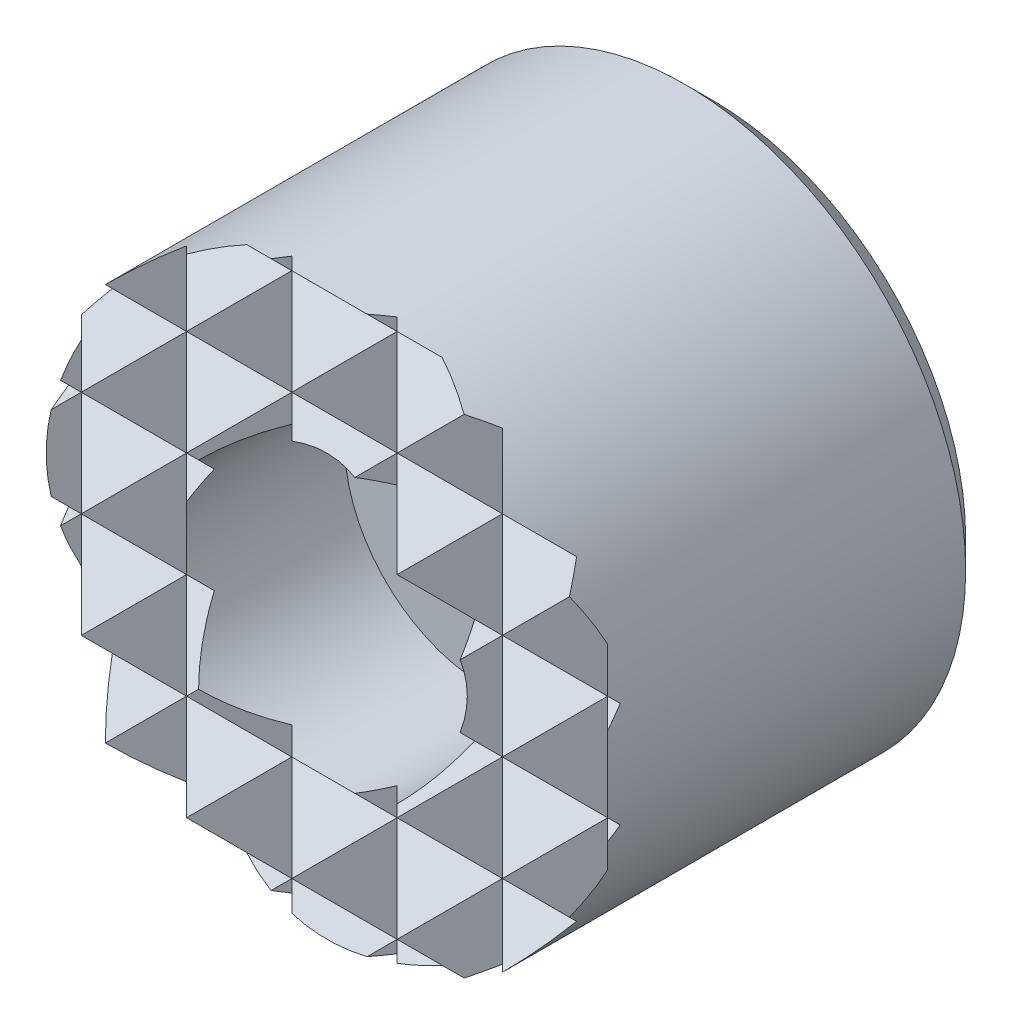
ISO-10303-21;
HEADER;
FILE_DESCRIPTION(('STEP AP214'),'2;1');
FILE_NAME('part.step','',(''),(''),'','','');
FILE_SCHEMA(('AUTOMOTIVE_DESIGN { 1 0 10303 214 1 1 1 1 }'));
ENDSEC;
DATA;
#1=APPLICATION_CONTEXT('core data for automotive mechanical design processes');
#2=APPLICATION_PROTOCOL_DEFINITION('international standard','automotive_design',2000,#1);
#3=PRODUCT_CONTEXT('',#1,'mechanical');
#4=PRODUCT('Part','Part','',(#3));
#5=PRODUCT_RELATED_PRODUCT_CATEGORY('part','',(#4));
#6=PRODUCT_DEFINITION_FORMATION('','',#4);
#7=PRODUCT_DEFINITION_CONTEXT('part definition',#1,'design');
#8=PRODUCT_DEFINITION('design','',#6,#7);
#9=PRODUCT_DEFINITION_SHAPE('','',#8);
#10=(LENGTH_UNIT() NAMED_UNIT(*) SI_UNIT(.MILLI.,.METRE.));
#11=(NAMED_UNIT(*) PLANE_ANGLE_UNIT() SI_UNIT($,.RADIAN.));
#12=(NAMED_UNIT(*) SI_UNIT($,.STERADIAN.) SOLID_ANGLE_UNIT());
#13=UNCERTAINTY_MEASURE_WITH_UNIT(LENGTH_MEASURE(1.E-05),#10,'distance_accuracy_value','');
#14=(GEOMETRIC_REPRESENTATION_CONTEXT(3) GLOBAL_UNCERTAINTY_ASSIGNED_CONTEXT((#13)) GLOBAL_UNIT_ASSIGNED_CONTEXT((#10,
#11,#12)) REPRESENTATION_CONTEXT('',''));
#15=CARTESIAN_POINT('',(0.,0.,0.));
#16=DIRECTION('',(0.,0.,1.));
#17=DIRECTION('',(1.,0.,0.));
#18=AXIS2_PLACEMENT_3D('',#15,#16,#17);
#19=CARTESIAN_POINT('',(-6.,-10.,12.));
#20=DIRECTION('',(-0.70710678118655,0.,-0.707106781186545));
#21=DIRECTION('',(-0.707106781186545,0.,0.70710678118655));
#22=AXIS2_PLACEMENT_3D('',#19,#20,#21);
#23=PLANE('',#22);
#24=DIRECTION('',(0.,1.,0.));
#25=VECTOR('',#24,1.);
#26=CARTESIAN_POINT('',(-4.5,-10.,10.5));
#27=LINE('',#26,#25);
#28=CARTESIAN_POINT('',(-4.5,-6.6143782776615,10.5));
#29=VERTEX_POINT('',#28);
#30=CARTESIAN_POINT('',(-4.5,-4.5,10.5));
#31=VERTEX_POINT('',#30);
#32=EDGE_CURVE('E665',#29,#31,#27,.T.);
#33=ORIENTED_EDGE('',*,*,#32,.T.);
#34=DIRECTION('',(-0.577350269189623,-0.577350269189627,0.577350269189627));
#35=VECTOR('',#34,1.);
#36=CARTESIAN_POINT('',(-7.33333333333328,-7.33333333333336,13.3333333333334));
#37=LINE('',#36,#35);
#38=CARTESIAN_POINT('',(-5.65685424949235,-5.65685424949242,11.6568542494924));
#39=VERTEX_POINT('',#38);
#40=EDGE_CURVE('E485',#31,#39,#37,.T.);
#41=ORIENTED_EDGE('',*,*,#40,.T.);
#42=CARTESIAN_POINT('',(0.,0.,6.));
#43=DIRECTION('',(-0.70710678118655,0.,-0.707106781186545));
#44=DIRECTION('',(0.707106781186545,0.,-0.70710678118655));
#45=AXIS2_PLACEMENT_3D('',#42,#43,#44);
#46=ELLIPSE('',#45,11.3137084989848,8.);
#47=EDGE_CURVE('E759',#29,#39,#46,.T.);
#48=ORIENTED_EDGE('',*,*,#47,.F.);
#49=EDGE_LOOP('',(#33,#41,#48));
#50=FACE_BOUND('',#49,.T.);
#51=ADVANCED_FACE('F15',(#50),#23,.F.);
#52=DIRECTION('',(-0.577350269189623,-0.577350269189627,0.577350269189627));
#53=VECTOR('',#52,1.);
#54=CARTESIAN_POINT('',(-9.33333333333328,-3.33333333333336,15.3333333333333));
#55=LINE('',#54,#53);
#56=CARTESIAN_POINT('',(-4.5,1.5,10.5));
#57=VERTEX_POINT('',#56);
#58=CARTESIAN_POINT('',(-6.,0.,12.));
#59=VERTEX_POINT('',#58);
#60=EDGE_CURVE('E604',#57,#59,#55,.T.);
#61=ORIENTED_EDGE('',*,*,#60,.T.);
#62=DIRECTION('',(0.577350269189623,-0.577350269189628,-0.577350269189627));
#63=VECTOR('',#62,1.);
#64=CARTESIAN_POINT('',(-2.66666666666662,-3.33333333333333,8.66666666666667));
#65=LINE('',#64,#63);
#66=CARTESIAN_POINT('',(-4.5,-1.5,10.5));
#67=VERTEX_POINT('',#66);
#68=EDGE_CURVE('E577',#59,#67,#65,.T.);
#69=ORIENTED_EDGE('',*,*,#68,.T.);
#70=EDGE_CURVE('E1214',#67,#57,#27,.T.);
#71=ORIENTED_EDGE('',*,*,#70,.T.);
#72=EDGE_LOOP('',(#61,#69,#71));
#73=FACE_BOUND('',#72,.T.);
#74=ADVANCED_FACE('F1153',(#73),#23,.F.);
#75=CARTESIAN_POINT('',(-5.65685424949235,5.65685424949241,11.6568542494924));
#76=VERTEX_POINT('',#75);
#77=CARTESIAN_POINT('',(-4.5,6.6143782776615,10.5));
#78=VERTEX_POINT('',#77);
#79=EDGE_CURVE('E763',#76,#78,#46,.T.);
#80=ORIENTED_EDGE('',*,*,#79,.F.);
#81=DIRECTION('',(0.577350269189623,-0.577350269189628,-0.577350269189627));
#82=VECTOR('',#81,1.);
#83=CARTESIAN_POINT('',(-0.666666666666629,0.666666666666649,6.66666666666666));
#84=LINE('',#83,#82);
#85=CARTESIAN_POINT('',(-4.5,4.5,10.5));
#86=VERTEX_POINT('',#85);
#87=EDGE_CURVE('E424',#76,#86,#84,.T.);
#88=ORIENTED_EDGE('',*,*,#87,.T.);
#89=EDGE_CURVE('E670',#86,#78,#27,.T.);
#90=ORIENTED_EDGE('',*,*,#89,.T.);
#91=EDGE_LOOP('',(#80,#88,#90));
#92=FACE_BOUND('',#91,.T.);
#93=ADVANCED_FACE('F1159',(#92),#23,.F.);
#94=CARTESIAN_POINT('',(4.5,-10.,10.5));
#95=DIRECTION('',(0.707106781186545,0.,-0.70710678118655));
#96=DIRECTION('',(-0.70710678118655,0.,-0.707106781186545));
#97=AXIS2_PLACEMENT_3D('',#94,#95,#96);
#98=PLANE('',#97);
#99=CARTESIAN_POINT('',(0.,0.,6.));
#100=DIRECTION('',(0.707106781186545,0.,-0.70710678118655));
#101=DIRECTION('',(-0.70710678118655,0.,-0.707106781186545));
#102=AXIS2_PLACEMENT_3D('',#99,#100,#101);
#103=ELLIPSE('',#102,11.3137084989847,8.);
#104=CARTESIAN_POINT('',(5.65685424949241,-5.65685424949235,11.6568542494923));
#105=VERTEX_POINT('',#104);
#106=CARTESIAN_POINT('',(4.5,-6.61437827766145,10.5));
#107=VERTEX_POINT('',#106);
#108=EDGE_CURVE('E764',#105,#107,#103,.T.);
#109=ORIENTED_EDGE('',*,*,#108,.F.);
#110=DIRECTION('',(-0.577350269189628,0.577350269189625,-0.577350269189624));
#111=VECTOR('',#110,1.);
#112=CARTESIAN_POINT('',(6.33333333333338,-6.33333333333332,12.3333333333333));
#113=LINE('',#112,#111);
#114=CARTESIAN_POINT('',(4.5,-4.5,10.5));
#115=VERTEX_POINT('',#114);
#116=EDGE_CURVE('E482',#105,#115,#113,.T.);
#117=ORIENTED_EDGE('',*,*,#116,.T.);
#118=DIRECTION('',(0.,1.,0.));
#119=VECTOR('',#118,1.);
#120=CARTESIAN_POINT('',(4.5,-10.,10.5));
#121=LINE('',#120,#119);
#122=EDGE_CURVE('E685',#107,#115,#121,.T.);
#123=ORIENTED_EDGE('',*,*,#122,.F.);
#124=EDGE_LOOP('',(#109,#117,#123));
#125=FACE_BOUND('',#124,.T.);
#126=ADVANCED_FACE('F1179',(#125),#98,.F.);
#127=CARTESIAN_POINT('',(4.5,-1.49999999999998,10.5));
#128=VERTEX_POINT('',#127);
#129=CARTESIAN_POINT('',(4.5,1.5,10.5));
#130=VERTEX_POINT('',#129);
#131=EDGE_CURVE('E1084',#128,#130,#121,.T.);
#132=ORIENTED_EDGE('',*,*,#131,.F.);
#133=DIRECTION('',(0.577350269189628,0.577350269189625,0.577350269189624));
#134=VECTOR('',#133,1.);
#135=CARTESIAN_POINT('',(1.6666666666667,-4.33333333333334,7.66666666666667));
#136=LINE('',#135,#134);
#137=CARTESIAN_POINT('',(6.,0.,12.));
#138=VERTEX_POINT('',#137);
#139=EDGE_CURVE('E558',#128,#138,#136,.T.);
#140=ORIENTED_EDGE('',*,*,#139,.T.);
#141=DIRECTION('',(-0.577350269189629,0.577350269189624,-0.577350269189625));
#142=VECTOR('',#141,1.);
#143=CARTESIAN_POINT('',(8.33333333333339,-2.3333333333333,14.3333333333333));
#144=LINE('',#143,#142);
#145=EDGE_CURVE('E586',#138,#130,#144,.T.);
#146=ORIENTED_EDGE('',*,*,#145,.T.);
#147=EDGE_LOOP('',(#132,#140,#146));
#148=FACE_BOUND('',#147,.T.);
#149=ADVANCED_FACE('F1184',(#148),#98,.F.);
#150=CARTESIAN_POINT('',(4.5,4.5,10.5));
#151=VERTEX_POINT('',#150);
#152=CARTESIAN_POINT('',(4.5,6.61437827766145,10.5));
#153=VERTEX_POINT('',#152);
#154=EDGE_CURVE('E688',#151,#153,#121,.T.);
#155=ORIENTED_EDGE('',*,*,#154,.F.);
#156=DIRECTION('',(0.577350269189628,0.577350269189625,0.577350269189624));
#157=VECTOR('',#156,1.);
#158=CARTESIAN_POINT('',(-0.333333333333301,-0.333333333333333,5.66666666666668));
#159=LINE('',#158,#157);
#160=CARTESIAN_POINT('',(5.65685424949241,5.65685424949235,11.6568542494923));
#161=VERTEX_POINT('',#160);
#162=EDGE_CURVE('E421',#151,#161,#159,.T.);
#163=ORIENTED_EDGE('',*,*,#162,.T.);
#164=EDGE_CURVE('E767',#153,#161,#103,.T.);
#165=ORIENTED_EDGE('',*,*,#164,.F.);
#166=EDGE_LOOP('',(#155,#163,#165));
#167=FACE_BOUND('',#166,.T.);
#168=ADVANCED_FACE('F1267',(#167),#98,.F.);
#169=CARTESIAN_POINT('',(6.,-10.,12.));
#170=DIRECTION('',(-0.70710678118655,0.,-0.707106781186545));
#171=DIRECTION('',(-0.707106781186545,0.,0.70710678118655));
#172=AXIS2_PLACEMENT_3D('',#169,#170,#171);
#173=PLANE('',#172);
#174=DIRECTION('',(-0.577350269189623,-0.577350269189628,0.577350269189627));
#175=VECTOR('',#174,1.);
#176=CARTESIAN_POINT('',(3.6666666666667,-5.33333333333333,14.3333333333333));
#177=LINE('',#176,#175);
#178=CARTESIAN_POINT('',(7.5,-1.5,10.5));
#179=VERTEX_POINT('',#178);
#180=CARTESIAN_POINT('',(6.,-3.,12.));
#181=VERTEX_POINT('',#180);
#182=EDGE_CURVE('E533',#179,#181,#177,.T.);
#183=ORIENTED_EDGE('',*,*,#182,.T.);
#184=DIRECTION('',(0.577350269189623,-0.577350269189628,-0.577350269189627));
#185=VECTOR('',#184,1.);
#186=CARTESIAN_POINT('',(8.33333333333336,-5.33333333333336,9.66666666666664));
#187=LINE('',#186,#185);
#188=CARTESIAN_POINT('',(6.95435605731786,-3.95435605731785,11.0456439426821));
#189=VERTEX_POINT('',#188);
#190=EDGE_CURVE('E512',#181,#189,#187,.T.);
#191=ORIENTED_EDGE('',*,*,#190,.T.);
#192=CARTESIAN_POINT('',(0.,0.,18.));
#193=DIRECTION('',(-0.70710678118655,0.,-0.707106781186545));
#194=DIRECTION('',(0.707106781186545,0.,-0.70710678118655));
#195=AXIS2_PLACEMENT_3D('',#192,#193,#194);
#196=ELLIPSE('',#195,11.3137084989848,8.);
#197=CARTESIAN_POINT('',(7.5,-2.78388218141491,10.5));
#198=VERTEX_POINT('',#197);
#199=EDGE_CURVE('E766',#198,#189,#196,.T.);
#200=ORIENTED_EDGE('',*,*,#199,.F.);
#201=DIRECTION('',(0.,1.,0.));
#202=VECTOR('',#201,1.);
#203=CARTESIAN_POINT('',(7.5,-10.,10.5));
#204=LINE('',#203,#202);
#205=EDGE_CURVE('E689',#198,#179,#204,.T.);
#206=ORIENTED_EDGE('',*,*,#205,.T.);
#207=EDGE_LOOP('',(#183,#191,#200,#206));
#208=FACE_BOUND('',#207,.T.);
#209=ADVANCED_FACE('F1030',(#208),#173,.F.);
#210=DIRECTION('',(-0.577350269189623,-0.577350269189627,0.577350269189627));
#211=VECTOR('',#210,1.);
#212=CARTESIAN_POINT('',(2.66666666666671,-3.33333333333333,15.3333333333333));
#213=LINE('',#212,#211);
#214=CARTESIAN_POINT('',(7.5,1.5,10.5));
#215=VERTEX_POINT('',#214);
#216=EDGE_CURVE('E591',#215,#138,#213,.T.);
#217=ORIENTED_EDGE('',*,*,#216,.T.);
#218=DIRECTION('',(0.577350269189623,-0.577350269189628,-0.577350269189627));
#219=VECTOR('',#218,1.);
#220=CARTESIAN_POINT('',(9.33333333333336,-3.33333333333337,8.66666666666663));
#221=LINE('',#220,#219);
#222=EDGE_CURVE('E563',#138,#179,#221,.T.);
#223=ORIENTED_EDGE('',*,*,#222,.T.);
#224=EDGE_CURVE('E692',#179,#215,#204,.T.);
#225=ORIENTED_EDGE('',*,*,#224,.T.);
#226=EDGE_LOOP('',(#217,#223,#225));
#227=FACE_BOUND('',#226,.T.);
#228=ADVANCED_FACE('F1037',(#227),#173,.F.);
#229=CARTESIAN_POINT('',(7.5,-10.,10.5));
#230=DIRECTION('',(0.707106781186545,0.,-0.70710678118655));
#231=DIRECTION('',(-0.70710678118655,0.,-0.707106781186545));
#232=AXIS2_PLACEMENT_3D('',#229,#230,#231);
#233=PLANE('',#232);
#234=CARTESIAN_POINT('',(7.5,2.78388218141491,10.5));
#235=VERTEX_POINT('',#234);
#236=EDGE_CURVE('E693',#215,#235,#204,.T.);
#237=ORIENTED_EDGE('',*,*,#236,.F.);
#238=DIRECTION('',(0.577350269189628,0.577350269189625,0.577350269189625));
#239=VECTOR('',#238,1.);
#240=CARTESIAN_POINT('',(3.6666666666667,-2.33333333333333,6.66666666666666));
#241=LINE('',#240,#239);
#242=CARTESIAN_POINT('',(7.79583152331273,1.79583152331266,10.7958315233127));
#243=VERTEX_POINT('',#242);
#244=EDGE_CURVE('E624',#215,#243,#241,.T.);
#245=ORIENTED_EDGE('',*,*,#244,.T.);
#246=CARTESIAN_POINT('',(0.,0.,3.));
#247=DIRECTION('',(0.707106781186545,0.,-0.70710678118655));
#248=DIRECTION('',(-0.70710678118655,0.,-0.707106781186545));
#249=AXIS2_PLACEMENT_3D('',#246,#247,#248);
#250=ELLIPSE('',#249,11.3137084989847,8.);
#251=EDGE_CURVE('E771',#235,#243,#250,.T.);
#252=ORIENTED_EDGE('',*,*,#251,.F.);
#253=EDGE_LOOP('',(#237,#245,#252));
#254=FACE_BOUND('',#253,.T.);
#255=ADVANCED_FACE('F1050',(#254),#233,.F.);
#256=CARTESIAN_POINT('',(7.92782730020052,1.07217269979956,10.9278273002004));
#257=VERTEX_POINT('',#256);
#258=CARTESIAN_POINT('',(7.92782730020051,-1.07217269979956,10.9278273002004));
#259=VERTEX_POINT('',#258);
#260=EDGE_CURVE('E774',#257,#259,#250,.T.);
#261=ORIENTED_EDGE('',*,*,#260,.F.);
#262=DIRECTION('',(-0.577350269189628,0.577350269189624,-0.577350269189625));
#263=VECTOR('',#262,1.);
#264=CARTESIAN_POINT('',(11.3333333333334,-2.33333333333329,14.3333333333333));
#265=LINE('',#264,#263);
#266=EDGE_CURVE('E595',#257,#215,#265,.T.);
#267=ORIENTED_EDGE('',*,*,#266,.T.);
#268=ORIENTED_EDGE('',*,*,#224,.F.);
#269=DIRECTION('',(0.577350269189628,0.577350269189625,0.577350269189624));
#270=VECTOR('',#269,1.);
#271=CARTESIAN_POINT('',(4.66666666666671,-4.33333333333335,7.66666666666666));
#272=LINE('',#271,#270);
#273=EDGE_CURVE('E567',#179,#259,#272,.T.);
#274=ORIENTED_EDGE('',*,*,#273,.T.);
#275=EDGE_LOOP('',(#261,#267,#268,#274));
#276=FACE_BOUND('',#275,.T.);
#277=ADVANCED_FACE('F1041',(#276),#233,.F.);
#278=CARTESIAN_POINT('',(-9.,-10.,12.));
#279=DIRECTION('',(-0.70710678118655,0.,-0.707106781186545));
#280=DIRECTION('',(-0.707106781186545,0.,0.70710678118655));
#281=AXIS2_PLACEMENT_3D('',#278,#279,#280);
#282=PLANE('',#281);
#283=CARTESIAN_POINT('',(0.,0.,3.));
#284=DIRECTION('',(-0.70710678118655,0.,-0.707106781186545));
#285=DIRECTION('',(0.707106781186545,0.,-0.70710678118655));
#286=AXIS2_PLACEMENT_3D('',#283,#284,#285);
#287=ELLIPSE('',#286,11.3137084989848,8.);
#288=CARTESIAN_POINT('',(-7.79583152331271,1.79583152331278,10.7958315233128));
#289=VERTEX_POINT('',#288);
#290=CARTESIAN_POINT('',(-7.5,2.78388218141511,10.5));
#291=VERTEX_POINT('',#290);
#292=EDGE_CURVE('E754',#289,#291,#287,.T.);
#293=ORIENTED_EDGE('',*,*,#292,.F.);
#294=DIRECTION('',(0.577350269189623,-0.577350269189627,-0.577350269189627));
#295=VECTOR('',#294,1.);
#296=CARTESIAN_POINT('',(-4.66666666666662,-1.33333333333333,7.66666666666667));
#297=LINE('',#296,#295);
#298=CARTESIAN_POINT('',(-7.5,1.5,10.5));
#299=VERTEX_POINT('',#298);
#300=EDGE_CURVE('E391',#289,#299,#297,.T.);
#301=ORIENTED_EDGE('',*,*,#300,.T.);
#302=DIRECTION('',(0.,1.,0.));
#303=VECTOR('',#302,1.);
#304=CARTESIAN_POINT('',(-7.5,-10.,10.5));
#305=LINE('',#304,#303);
#306=EDGE_CURVE('E389',#299,#291,#305,.T.);
#307=ORIENTED_EDGE('',*,*,#306,.T.);
#308=EDGE_LOOP('',(#293,#301,#307));
#309=FACE_BOUND('',#308,.T.);
#310=ADVANCED_FACE('F1443',(#309),#282,.F.);
#311=CARTESIAN_POINT('',(-7.5,-1.5,10.5));
#312=VERTEX_POINT('',#311);
#313=EDGE_CURVE('E697',#312,#299,#305,.T.);
#314=ORIENTED_EDGE('',*,*,#313,.T.);
#315=DIRECTION('',(-0.577350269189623,-0.577350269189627,0.577350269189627));
#316=VECTOR('',#315,1.);
#317=CARTESIAN_POINT('',(-12.3333333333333,-3.33333333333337,15.3333333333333));
#318=LINE('',#317,#316);
#319=CARTESIAN_POINT('',(-7.92782730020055,1.07217269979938,10.9278273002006));
#320=VERTEX_POINT('',#319);
#321=EDGE_CURVE('E610',#299,#320,#318,.T.);
#322=ORIENTED_EDGE('',*,*,#321,.T.);
#323=CARTESIAN_POINT('',(-7.92782730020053,-1.0721726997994,10.9278273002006));
#324=VERTEX_POINT('',#323);
#325=EDGE_CURVE('E760',#324,#320,#287,.T.);
#326=ORIENTED_EDGE('',*,*,#325,.F.);
#327=DIRECTION('',(0.577350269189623,-0.577350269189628,-0.577350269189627));
#328=VECTOR('',#327,1.);
#329=CARTESIAN_POINT('',(-5.66666666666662,-3.33333333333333,8.66666666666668));
#330=LINE('',#329,#328);
#331=EDGE_CURVE('E583',#324,#312,#330,.T.);
#332=ORIENTED_EDGE('',*,*,#331,.T.);
#333=EDGE_LOOP('',(#314,#322,#326,#332));
#334=FACE_BOUND('',#333,.T.);
#335=ADVANCED_FACE('F982',(#334),#282,.F.);
#336=CARTESIAN_POINT('',(-7.5,-10.,10.5));
#337=DIRECTION('',(0.707106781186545,0.,-0.70710678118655));
#338=DIRECTION('',(-0.70710678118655,0.,-0.707106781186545));
#339=AXIS2_PLACEMENT_3D('',#336,#337,#338);
#340=PLANE('',#339);
#341=CARTESIAN_POINT('',(0.,0.,18.));
#342=DIRECTION('',(0.707106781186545,0.,-0.70710678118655));
#343=DIRECTION('',(-0.70710678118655,0.,-0.707106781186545));
#344=AXIS2_PLACEMENT_3D('',#341,#342,#343);
#345=ELLIPSE('',#344,11.3137084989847,8.);
#346=CARTESIAN_POINT('',(-6.95435605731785,-3.95435605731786,11.0456439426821));
#347=VERTEX_POINT('',#346);
#348=CARTESIAN_POINT('',(-7.5,-2.78388218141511,10.5));
#349=VERTEX_POINT('',#348);
#350=EDGE_CURVE('E752',#347,#349,#345,.T.);
#351=ORIENTED_EDGE('',*,*,#350,.F.);
#352=DIRECTION('',(0.577350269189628,0.577350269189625,0.577350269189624));
#353=VECTOR('',#352,1.);
#354=CARTESIAN_POINT('',(-9.33333333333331,-6.33333333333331,8.6666666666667));
#355=LINE('',#354,#353);
#356=CARTESIAN_POINT('',(-6.,-3.,12.));
#357=VERTEX_POINT('',#356);
#358=EDGE_CURVE('E521',#347,#357,#355,.T.);
#359=ORIENTED_EDGE('',*,*,#358,.T.);
#360=DIRECTION('',(-0.577350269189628,0.577350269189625,-0.577350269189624));
#361=VECTOR('',#360,1.);
#362=CARTESIAN_POINT('',(-4.66666666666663,-4.33333333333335,13.3333333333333));
#363=LINE('',#362,#361);
#364=EDGE_CURVE('E552',#357,#312,#363,.T.);
#365=ORIENTED_EDGE('',*,*,#364,.T.);
#366=EDGE_CURVE('E694',#349,#312,#305,.T.);
#367=ORIENTED_EDGE('',*,*,#366,.F.);
#368=EDGE_LOOP('',(#351,#359,#365,#367));
#369=FACE_BOUND('',#368,.T.);
#370=ADVANCED_FACE('F1450',(#369),#340,.F.);
#371=ORIENTED_EDGE('',*,*,#313,.F.);
#372=DIRECTION('',(0.577350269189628,0.577350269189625,0.577350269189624));
#373=VECTOR('',#372,1.);
#374=CARTESIAN_POINT('',(-10.3333333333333,-4.33333333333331,7.6666666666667));
#375=LINE('',#374,#373);
#376=EDGE_CURVE('E580',#312,#59,#375,.T.);
#377=ORIENTED_EDGE('',*,*,#376,.T.);
#378=DIRECTION('',(-0.577350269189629,0.577350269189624,-0.577350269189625));
#379=VECTOR('',#378,1.);
#380=CARTESIAN_POINT('',(-3.66666666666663,-2.33333333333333,14.3333333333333));
#381=LINE('',#380,#379);
#382=EDGE_CURVE('E607',#59,#299,#381,.T.);
#383=ORIENTED_EDGE('',*,*,#382,.T.);
#384=EDGE_LOOP('',(#371,#377,#383));
#385=FACE_BOUND('',#384,.T.);
#386=ADVANCED_FACE('F987',(#385),#340,.F.);
#387=CARTESIAN_POINT('',(-4.5,-10.,10.5));
#388=DIRECTION('',(0.707106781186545,0.,-0.707106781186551));
#389=DIRECTION('',(-0.707106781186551,0.,-0.707106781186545));
#390=AXIS2_PLACEMENT_3D('',#387,#388,#389);
#391=PLANE('',#390);
#392=ORIENTED_EDGE('',*,*,#70,.F.);
#393=DIRECTION('',(0.577350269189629,0.577350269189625,0.577350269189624));
#394=VECTOR('',#393,1.);
#395=CARTESIAN_POINT('',(-7.33333333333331,-4.33333333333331,7.66666666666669));
#396=LINE('',#395,#394);
#397=CARTESIAN_POINT('',(-3.89791576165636,-0.897915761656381,11.1020842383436));
#398=VERTEX_POINT('',#397);
#399=EDGE_CURVE('E573',#67,#398,#396,.T.);
#400=ORIENTED_EDGE('',*,*,#399,.T.);
#401=CARTESIAN_POINT('',(0.,0.,15.));
#402=DIRECTION('',(0.707106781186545,0.,-0.707106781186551));
#403=DIRECTION('',(0.707106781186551,0.,0.707106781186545));
#404=AXIS2_PLACEMENT_3D('',#401,#402,#403);
#405=ELLIPSE('',#404,5.65685424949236,4.);
#406=CARTESIAN_POINT('',(-3.89791576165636,0.897915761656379,11.1020842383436));
#407=VERTEX_POINT('',#406);
#408=EDGE_CURVE('E749',#398,#407,#405,.T.);
#409=ORIENTED_EDGE('',*,*,#408,.T.);
#410=DIRECTION('',(-0.577350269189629,0.577350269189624,-0.577350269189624));
#411=VECTOR('',#410,1.);
#412=CARTESIAN_POINT('',(-0.666666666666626,-2.33333333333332,14.3333333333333));
#413=LINE('',#412,#411);
#414=EDGE_CURVE('E601',#407,#57,#413,.T.);
#415=ORIENTED_EDGE('',*,*,#414,.T.);
#416=EDGE_LOOP('',(#392,#400,#409,#415));
#417=FACE_BOUND('',#416,.T.);
#418=ADVANCED_FACE('F1174',(#417),#391,.F.);
#419=DIRECTION('',(0.577350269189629,0.577350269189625,0.577350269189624));
#420=VECTOR('',#419,1.);
#421=CARTESIAN_POINT('',(-5.33333333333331,-8.33333333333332,9.66666666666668));
#422=LINE('',#421,#420);
#423=CARTESIAN_POINT('',(-3.95435605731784,-6.95435605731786,11.0456439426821));
#424=VERTEX_POINT('',#423);
#425=CARTESIAN_POINT('',(-2.99999999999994,-6.,12.));
#426=VERTEX_POINT('',#425);
#427=EDGE_CURVE('E461',#424,#426,#422,.T.);
#428=ORIENTED_EDGE('',*,*,#427,.T.);
#429=DIRECTION('',(-0.577350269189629,0.577350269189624,-0.577350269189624));
#430=VECTOR('',#429,1.);
#431=CARTESIAN_POINT('',(-2.66666666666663,-6.33333333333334,12.3333333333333));
#432=LINE('',#431,#430);
#433=EDGE_CURVE('E479',#426,#31,#432,.T.);
#434=ORIENTED_EDGE('',*,*,#433,.T.);
#435=ORIENTED_EDGE('',*,*,#32,.F.);
#436=CARTESIAN_POINT('',(0.,0.,15.));
#437=DIRECTION('',(0.707106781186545,0.,-0.707106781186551));
#438=DIRECTION('',(-0.707106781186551,0.,-0.707106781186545));
#439=AXIS2_PLACEMENT_3D('',#436,#437,#438);
#440=ELLIPSE('',#439,11.3137084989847,8.);
#441=EDGE_CURVE('E712',#424,#29,#440,.T.);
#442=ORIENTED_EDGE('',*,*,#441,.F.);
#443=EDGE_LOOP('',(#428,#434,#435,#442));
#444=FACE_BOUND('',#443,.T.);
#445=ADVANCED_FACE('F862',(#444),#391,.F.);
#446=DIRECTION('',(0.577350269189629,0.577350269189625,0.577350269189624));
#447=VECTOR('',#446,1.);
#448=CARTESIAN_POINT('',(-9.33333333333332,-0.333333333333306,5.6666666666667));
#449=LINE('',#448,#447);
#450=CARTESIAN_POINT('',(-2.99999999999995,6.,12.));
#451=VERTEX_POINT('',#450);
#452=EDGE_CURVE('E418',#86,#451,#449,.T.);
#453=ORIENTED_EDGE('',*,*,#452,.T.);
#454=DIRECTION('',(-0.577350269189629,0.577350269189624,-0.577350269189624));
#455=VECTOR('',#454,1.);
#456=CARTESIAN_POINT('',(1.33333333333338,1.66666666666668,16.3333333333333));
#457=LINE('',#456,#455);
#458=CARTESIAN_POINT('',(-3.95435605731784,6.95435605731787,11.0456439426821));
#459=VERTEX_POINT('',#458);
#460=EDGE_CURVE('E442',#451,#459,#457,.T.);
#461=ORIENTED_EDGE('',*,*,#460,.T.);
#462=EDGE_CURVE('E714',#78,#459,#440,.T.);
#463=ORIENTED_EDGE('',*,*,#462,.F.);
#464=ORIENTED_EDGE('',*,*,#89,.F.);
#465=EDGE_LOOP('',(#453,#461,#463,#464));
#466=FACE_BOUND('',#465,.T.);
#467=ADVANCED_FACE('F1177',(#466),#391,.F.);
#468=CARTESIAN_POINT('',(-2.99999999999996,-10.,12.));
#469=DIRECTION('',(-0.70710678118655,0.,-0.707106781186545));
#470=DIRECTION('',(-0.707106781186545,0.,0.70710678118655));
#471=AXIS2_PLACEMENT_3D('',#468,#469,#470);
#472=PLANE('',#471);
#473=CARTESIAN_POINT('',(0.,0.,9.));
#474=DIRECTION('',(-0.70710678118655,0.,-0.707106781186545));
#475=DIRECTION('',(-0.707106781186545,0.,0.70710678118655));
#476=AXIS2_PLACEMENT_3D('',#473,#474,#475);
#477=ELLIPSE('',#476,5.6568542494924,4.);
#478=CARTESIAN_POINT('',(-1.49999999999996,-3.70809924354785,10.5));
#479=VERTEX_POINT('',#478);
#480=CARTESIAN_POINT('',(-2.82842712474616,-2.82842712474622,11.8284271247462));
#481=VERTEX_POINT('',#480);
#482=EDGE_CURVE('E745',#479,#481,#477,.T.);
#483=ORIENTED_EDGE('',*,*,#482,.T.);
#484=DIRECTION('',(-0.577350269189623,-0.577350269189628,0.577350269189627));
#485=VECTOR('',#484,1.);
#486=CARTESIAN_POINT('',(-5.33333333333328,-5.33333333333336,14.3333333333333));
#487=LINE('',#486,#485);
#488=CARTESIAN_POINT('',(-2.99999999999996,-3.,12.));
#489=VERTEX_POINT('',#488);
#490=EDGE_CURVE('E543',#481,#489,#487,.T.);
#491=ORIENTED_EDGE('',*,*,#490,.T.);
#492=DIRECTION('',(0.577350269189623,-0.577350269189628,-0.577350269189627));
#493=VECTOR('',#492,1.);
#494=CARTESIAN_POINT('',(-0.666666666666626,-5.33333333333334,9.66666666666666));
#495=LINE('',#494,#493);
#496=CARTESIAN_POINT('',(-1.49999999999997,-4.5,10.5));
#497=VERTEX_POINT('',#496);
#498=EDGE_CURVE('E506',#489,#497,#495,.T.);
#499=ORIENTED_EDGE('',*,*,#498,.T.);
#500=DIRECTION('',(0.,1.,0.));
#501=VECTOR('',#500,1.);
#502=CARTESIAN_POINT('',(-1.49999999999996,-10.,10.5));
#503=LINE('',#502,#501);
#504=EDGE_CURVE('E674',#497,#479,#503,.T.);
#505=ORIENTED_EDGE('',*,*,#504,.T.);
#506=EDGE_LOOP('',(#483,#491,#499,#505));
#507=FACE_BOUND('',#506,.T.);
#508=ADVANCED_FACE('F1218',(#507),#472,.F.);
#509=CARTESIAN_POINT('',(0.,0.,9.));
#510=DIRECTION('',(-0.70710678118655,0.,-0.707106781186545));
#511=DIRECTION('',(0.707106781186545,0.,-0.70710678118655));
#512=AXIS2_PLACEMENT_3D('',#509,#510,#511);
#513=ELLIPSE('',#512,11.3137084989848,8.);
#514=CARTESIAN_POINT('',(-1.79583152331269,7.79583152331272,10.7958315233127));
#515=VERTEX_POINT('',#514);
#516=CARTESIAN_POINT('',(-1.49999999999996,7.85811682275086,10.5));
#517=VERTEX_POINT('',#516);
#518=EDGE_CURVE('E709',#515,#517,#513,.T.);
#519=ORIENTED_EDGE('',*,*,#518,.F.);
#520=DIRECTION('',(0.577350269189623,-0.577350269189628,-0.577350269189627));
#521=VECTOR('',#520,1.);
#522=CARTESIAN_POINT('',(3.33333333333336,2.66666666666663,5.66666666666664));
#523=LINE('',#522,#521);
#524=CARTESIAN_POINT('',(-1.49999999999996,7.5,10.5));
#525=VERTEX_POINT('',#524);
#526=EDGE_CURVE('E662',#515,#525,#523,.T.);
#527=ORIENTED_EDGE('',*,*,#526,.T.);
#528=EDGE_CURVE('E676',#525,#517,#503,.T.);
#529=ORIENTED_EDGE('',*,*,#528,.T.);
#530=EDGE_LOOP('',(#519,#527,#529));
#531=FACE_BOUND('',#530,.T.);
#532=ADVANCED_FACE('F1129',(#531),#472,.F.);
#533=CARTESIAN_POINT('',(-1.49999999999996,-10.,10.5));
#534=DIRECTION('',(0.707106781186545,0.,-0.70710678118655));
#535=DIRECTION('',(-0.70710678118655,0.,-0.707106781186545));
#536=AXIS2_PLACEMENT_3D('',#533,#534,#535);
#537=PLANE('',#536);
#538=ORIENTED_EDGE('',*,*,#528,.F.);
#539=DIRECTION('',(0.577350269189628,0.577350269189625,0.577350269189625));
#540=VECTOR('',#539,1.);
#541=CARTESIAN_POINT('',(-7.33333333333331,1.66666666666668,4.66666666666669));
#542=LINE('',#541,#540);
#543=CARTESIAN_POINT('',(-1.07217269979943,7.92782730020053,10.9278273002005));
#544=VERTEX_POINT('',#543);
#545=EDGE_CURVE('E659',#525,#544,#542,.T.);
#546=ORIENTED_EDGE('',*,*,#545,.T.);
#547=CARTESIAN_POINT('',(0.,0.,12.));
#548=DIRECTION('',(0.707106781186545,0.,-0.70710678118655));
#549=DIRECTION('',(-0.70710678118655,0.,-0.707106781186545));
#550=AXIS2_PLACEMENT_3D('',#547,#548,#549);
#551=ELLIPSE('',#550,11.3137084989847,8.);
#552=EDGE_CURVE('E708',#517,#544,#551,.T.);
#553=ORIENTED_EDGE('',*,*,#552,.F.);
#554=EDGE_LOOP('',(#538,#546,#553));
#555=FACE_BOUND('',#554,.T.);
#556=ADVANCED_FACE('F1131',(#555),#537,.F.);
#557=ORIENTED_EDGE('',*,*,#504,.F.);
#558=DIRECTION('',(0.577350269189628,0.577350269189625,0.577350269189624));
#559=VECTOR('',#558,1.);
#560=CARTESIAN_POINT('',(-3.33333333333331,-6.33333333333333,8.66666666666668));
#561=LINE('',#560,#559);
#562=CARTESIAN_POINT('',(-0.89791576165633,-3.89791576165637,11.1020842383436));
#563=VERTEX_POINT('',#562);
#564=EDGE_CURVE('E503',#497,#563,#561,.T.);
#565=ORIENTED_EDGE('',*,*,#564,.T.);
#566=CARTESIAN_POINT('',(0.,0.,12.));
#567=DIRECTION('',(0.707106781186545,0.,-0.70710678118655));
#568=DIRECTION('',(0.70710678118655,0.,0.707106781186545));
#569=AXIS2_PLACEMENT_3D('',#566,#567,#568);
#570=ELLIPSE('',#569,5.65685424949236,4.);
#571=EDGE_CURVE('E744',#563,#479,#570,.T.);
#572=ORIENTED_EDGE('',*,*,#571,.T.);
#573=EDGE_LOOP('',(#557,#565,#572));
#574=FACE_BOUND('',#573,.T.);
#575=ADVANCED_FACE('F1121',(#574),#537,.F.);
#576=CARTESIAN_POINT('',(0.,-10.,12.));
#577=DIRECTION('',(-0.70710678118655,0.,-0.707106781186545));
#578=DIRECTION('',(-0.707106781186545,0.,0.70710678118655));
#579=AXIS2_PLACEMENT_3D('',#576,#577,#578);
#580=PLANE('',#579);
#581=CARTESIAN_POINT('',(0.,0.,12.));
#582=DIRECTION('',(-0.70710678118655,0.,-0.707106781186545));
#583=DIRECTION('',(-0.707106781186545,0.,0.70710678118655));
#584=AXIS2_PLACEMENT_3D('',#581,#582,#583);
#585=ELLIPSE('',#584,5.6568542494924,4.);
#586=CARTESIAN_POINT('',(1.50000000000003,-3.70809924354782,10.5));
#587=VERTEX_POINT('',#586);
#588=CARTESIAN_POINT('',(0.897915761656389,-3.89791576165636,11.1020842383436));
#589=VERTEX_POINT('',#588);
#590=EDGE_CURVE('E737',#587,#589,#585,.T.);
#591=ORIENTED_EDGE('',*,*,#590,.T.);
#592=DIRECTION('',(0.577350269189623,-0.577350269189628,-0.577350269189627));
#593=VECTOR('',#592,1.);
#594=CARTESIAN_POINT('',(2.33333333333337,-5.33333333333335,9.66666666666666));
#595=LINE('',#594,#593);
#596=CARTESIAN_POINT('',(1.50000000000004,-4.5,10.5));
#597=VERTEX_POINT('',#596);
#598=EDGE_CURVE('E495',#589,#597,#595,.T.);
#599=ORIENTED_EDGE('',*,*,#598,.T.);
#600=DIRECTION('',(0.,1.,0.));
#601=VECTOR('',#600,1.);
#602=CARTESIAN_POINT('',(1.50000000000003,-10.,10.5));
#603=LINE('',#602,#601);
#604=EDGE_CURVE('E681',#597,#587,#603,.T.);
#605=ORIENTED_EDGE('',*,*,#604,.T.);
#606=EDGE_LOOP('',(#591,#599,#605));
#607=FACE_BOUND('',#606,.T.);
#608=ADVANCED_FACE('F1110',(#607),#580,.F.);
#609=CARTESIAN_POINT('',(0.,0.,12.));
#610=DIRECTION('',(-0.70710678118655,0.,-0.707106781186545));
#611=DIRECTION('',(0.707106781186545,0.,-0.70710678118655));
#612=AXIS2_PLACEMENT_3D('',#609,#610,#611);
#613=ELLIPSE('',#612,11.3137084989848,8.);
#614=CARTESIAN_POINT('',(1.07217269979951,7.92782730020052,10.9278273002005));
#615=VERTEX_POINT('',#614);
#616=CARTESIAN_POINT('',(1.50000000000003,7.85811682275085,10.5));
#617=VERTEX_POINT('',#616);
#618=EDGE_CURVE('E703',#615,#617,#613,.T.);
#619=ORIENTED_EDGE('',*,*,#618,.F.);
#620=DIRECTION('',(0.577350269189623,-0.577350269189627,-0.577350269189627));
#621=VECTOR('',#620,1.);
#622=CARTESIAN_POINT('',(6.33333333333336,2.66666666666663,5.66666666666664));
#623=LINE('',#622,#621);
#624=CARTESIAN_POINT('',(1.50000000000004,7.5,10.5));
#625=VERTEX_POINT('',#624);
#626=EDGE_CURVE('E651',#615,#625,#623,.T.);
#627=ORIENTED_EDGE('',*,*,#626,.T.);
#628=EDGE_CURVE('E683',#625,#617,#603,.T.);
#629=ORIENTED_EDGE('',*,*,#628,.T.);
#630=EDGE_LOOP('',(#619,#627,#629));
#631=FACE_BOUND('',#630,.T.);
#632=ADVANCED_FACE('F968',(#631),#580,.F.);
#633=CARTESIAN_POINT('',(1.50000000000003,-10.,10.5));
#634=DIRECTION('',(0.707106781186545,0.,-0.70710678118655));
#635=DIRECTION('',(-0.70710678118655,0.,-0.707106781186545));
#636=AXIS2_PLACEMENT_3D('',#633,#634,#635);
#637=PLANE('',#636);
#638=ORIENTED_EDGE('',*,*,#628,.F.);
#639=DIRECTION('',(0.577350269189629,0.577350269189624,0.577350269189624));
#640=VECTOR('',#639,1.);
#641=CARTESIAN_POINT('',(-4.33333333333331,1.66666666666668,4.6666666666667));
#642=LINE('',#641,#640);
#643=CARTESIAN_POINT('',(1.79583152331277,7.79583152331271,10.7958315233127));
#644=VERTEX_POINT('',#643);
#645=EDGE_CURVE('E9',#625,#644,#642,.T.);
#646=ORIENTED_EDGE('',*,*,#645,.T.);
#647=CARTESIAN_POINT('',(0.,0.,9.));
#648=DIRECTION('',(0.707106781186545,0.,-0.70710678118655));
#649=DIRECTION('',(-0.70710678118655,0.,-0.707106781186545));
#650=AXIS2_PLACEMENT_3D('',#647,#648,#649);
#651=ELLIPSE('',#650,11.3137084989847,8.);
#652=EDGE_CURVE('E702',#617,#644,#651,.T.);
#653=ORIENTED_EDGE('',*,*,#652,.F.);
#654=EDGE_LOOP('',(#638,#646,#653));
#655=FACE_BOUND('',#654,.T.);
#656=ADVANCED_FACE('F971',(#655),#637,.F.);
#657=DIRECTION('',(0.577350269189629,0.577350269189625,0.577350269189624));
#658=VECTOR('',#657,1.);
#659=CARTESIAN_POINT('',(-0.3333333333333,-6.33333333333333,8.66666666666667));
#660=LINE('',#659,#658);
#661=CARTESIAN_POINT('',(3.00000000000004,-3.,12.));
#662=VERTEX_POINT('',#661);
#663=EDGE_CURVE('E492',#597,#662,#660,.T.);
#664=ORIENTED_EDGE('',*,*,#663,.T.);
#665=DIRECTION('',(-0.577350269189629,0.577350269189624,-0.577350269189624));
#666=VECTOR('',#665,1.);
#667=CARTESIAN_POINT('',(4.33333333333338,-4.33333333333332,13.3333333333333));
#668=LINE('',#667,#666);
#669=CARTESIAN_POINT('',(2.82842712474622,-2.82842712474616,11.8284271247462));
#670=VERTEX_POINT('',#669);
#671=EDGE_CURVE('E525',#662,#670,#668,.T.);
#672=ORIENTED_EDGE('',*,*,#671,.T.);
#673=CARTESIAN_POINT('',(0.,0.,9.));
#674=DIRECTION('',(0.707106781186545,0.,-0.70710678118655));
#675=DIRECTION('',(0.70710678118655,0.,0.707106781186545));
#676=AXIS2_PLACEMENT_3D('',#673,#674,#675);
#677=ELLIPSE('',#676,5.65685424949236,4.);
#678=EDGE_CURVE('E736',#670,#587,#677,.T.);
#679=ORIENTED_EDGE('',*,*,#678,.T.);
#680=ORIENTED_EDGE('',*,*,#604,.F.);
#681=EDGE_LOOP('',(#664,#672,#679,#680));
#682=FACE_BOUND('',#681,.T.);
#683=ADVANCED_FACE('F1101',(#682),#637,.F.);
#684=CARTESIAN_POINT('',(3.00000000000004,-10.,12.));
#685=DIRECTION('',(-0.70710678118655,0.,-0.707106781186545));
#686=DIRECTION('',(-0.707106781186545,0.,0.70710678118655));
#687=AXIS2_PLACEMENT_3D('',#684,#685,#686);
#688=PLANE('',#687);
#689=CARTESIAN_POINT('',(0.,0.,15.));
#690=DIRECTION('',(-0.70710678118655,0.,-0.707106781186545));
#691=DIRECTION('',(-0.707106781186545,0.,0.70710678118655));
#692=AXIS2_PLACEMENT_3D('',#689,#690,#691);
#693=ELLIPSE('',#692,5.6568542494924,4.);
#694=CARTESIAN_POINT('',(3.89791576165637,0.897915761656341,11.1020842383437));
#695=VERTEX_POINT('',#694);
#696=CARTESIAN_POINT('',(3.89791576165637,-0.897915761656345,11.1020842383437));
#697=VERTEX_POINT('',#696);
#698=EDGE_CURVE('E730',#695,#697,#693,.T.);
#699=ORIENTED_EDGE('',*,*,#698,.T.);
#700=DIRECTION('',(0.577350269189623,-0.577350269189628,-0.577350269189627));
#701=VECTOR('',#700,1.);
#702=CARTESIAN_POINT('',(6.33333333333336,-3.33333333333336,8.66666666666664));
#703=LINE('',#702,#701);
#704=EDGE_CURVE('E801',#697,#128,#703,.T.);
#705=ORIENTED_EDGE('',*,*,#704,.T.);
#706=ORIENTED_EDGE('',*,*,#131,.T.);
#707=DIRECTION('',(-0.577350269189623,-0.577350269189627,0.577350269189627));
#708=VECTOR('',#707,1.);
#709=CARTESIAN_POINT('',(-0.333333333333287,-3.33333333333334,15.3333333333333));
#710=LINE('',#709,#708);
#711=EDGE_CURVE('E787',#130,#695,#710,.T.);
#712=ORIENTED_EDGE('',*,*,#711,.T.);
#713=EDGE_LOOP('',(#699,#705,#706,#712));
#714=FACE_BOUND('',#713,.T.);
#715=ADVANCED_FACE('F1083',(#714),#688,.F.);
#716=ORIENTED_EDGE('',*,*,#122,.T.);
#717=DIRECTION('',(-0.577350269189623,-0.577350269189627,0.577350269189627));
#718=VECTOR('',#717,1.);
#719=CARTESIAN_POINT('',(1.66666666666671,-7.33333333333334,13.3333333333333));
#720=LINE('',#719,#718);
#721=CARTESIAN_POINT('',(3.00000000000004,-6.,12.));
#722=VERTEX_POINT('',#721);
#723=EDGE_CURVE('E793',#115,#722,#720,.T.);
#724=ORIENTED_EDGE('',*,*,#723,.T.);
#725=DIRECTION('',(0.577350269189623,-0.577350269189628,-0.577350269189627));
#726=VECTOR('',#725,1.);
#727=CARTESIAN_POINT('',(4.33333333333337,-7.33333333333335,10.6666666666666));
#728=LINE('',#727,#726);
#729=CARTESIAN_POINT('',(3.95435605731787,-6.95435605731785,11.0456439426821));
#730=VERTEX_POINT('',#729);
#731=EDGE_CURVE('E790',#722,#730,#728,.T.);
#732=ORIENTED_EDGE('',*,*,#731,.T.);
#733=CARTESIAN_POINT('',(0.,0.,15.));
#734=DIRECTION('',(-0.70710678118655,0.,-0.707106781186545));
#735=DIRECTION('',(0.707106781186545,0.,-0.70710678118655));
#736=AXIS2_PLACEMENT_3D('',#733,#734,#735);
#737=ELLIPSE('',#736,11.3137084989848,8.);
#738=EDGE_CURVE('E699',#107,#730,#737,.T.);
#739=ORIENTED_EDGE('',*,*,#738,.F.);
#740=EDGE_LOOP('',(#716,#724,#732,#739));
#741=FACE_BOUND('',#740,.T.);
#742=ADVANCED_FACE('F1255',(#741),#688,.F.);
#743=CARTESIAN_POINT('',(3.95435605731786,6.95435605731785,11.0456439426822));
#744=VERTEX_POINT('',#743);
#745=EDGE_CURVE('E668',#744,#153,#737,.T.);
#746=ORIENTED_EDGE('',*,*,#745,.F.);
#747=DIRECTION('',(-0.577350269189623,-0.577350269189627,0.577350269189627));
#748=VECTOR('',#747,1.);
#749=CARTESIAN_POINT('',(-2.33333333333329,0.666666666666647,17.3333333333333));
#750=LINE('',#749,#748);
#751=CARTESIAN_POINT('',(3.00000000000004,6.,12.));
#752=VERTEX_POINT('',#751);
#753=EDGE_CURVE('E782',#744,#752,#750,.T.);
#754=ORIENTED_EDGE('',*,*,#753,.T.);
#755=DIRECTION('',(0.577350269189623,-0.577350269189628,-0.577350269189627));
#756=VECTOR('',#755,1.);
#757=CARTESIAN_POINT('',(8.33333333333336,0.666666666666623,6.66666666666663));
#758=LINE('',#757,#756);
#759=EDGE_CURVE('E779',#752,#151,#758,.T.);
#760=ORIENTED_EDGE('',*,*,#759,.T.);
#761=ORIENTED_EDGE('',*,*,#154,.T.);
#762=EDGE_LOOP('',(#746,#754,#760,#761));
#763=FACE_BOUND('',#762,.T.);
#764=ADVANCED_FACE('F1265',(#763),#688,.F.);
#765=CARTESIAN_POINT('',(0.,0.,12.));
#766=DIRECTION('',(0.,0.,-1.));
#767=DIRECTION('',(-1.,0.,0.));
#768=AXIS2_PLACEMENT_3D('',#765,#766,#767);
#769=CYLINDRICAL_SURFACE('',#768,8.);
#770=CARTESIAN_POINT('',(0.,0.,0.8));
#771=DIRECTION('',(0.,0.,1.));
#772=DIRECTION('',(1.,0.,0.));
#773=AXIS2_PLACEMENT_3D('',#770,#771,#772);
#774=CIRCLE('',#773,8.);
#775=CARTESIAN_POINT('',(8.,0.,0.8));
#776=VERTEX_POINT('',#775);
#777=EDGE_CURVE('E724',#776,#776,#774,.T.);
#778=ORIENTED_EDGE('',*,*,#777,.T.);
#779=EDGE_LOOP('',(#778));
#780=FACE_BOUND('',#779,.T.);
#781=ORIENTED_EDGE('',*,*,#251,.T.);
#782=CARTESIAN_POINT('',(0.,0.,9.));
#783=DIRECTION('',(0.,0.707106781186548,-0.707106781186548));
#784=DIRECTION('',(0.,-0.707106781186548,-0.707106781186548));
#785=AXIS2_PLACEMENT_3D('',#782,#783,#784);
#786=ELLIPSE('',#785,11.3137084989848,8.);
#787=CARTESIAN_POINT('',(7.85811682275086,1.5,10.5));
#788=VERTEX_POINT('',#787);
#789=EDGE_CURVE('E627',#243,#788,#786,.T.);
#790=ORIENTED_EDGE('',*,*,#789,.T.);
#791=CARTESIAN_POINT('',(0.,0.,12.));
#792=DIRECTION('',(0.,-0.707106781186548,-0.707106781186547));
#793=DIRECTION('',(0.,0.707106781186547,-0.707106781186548));
#794=AXIS2_PLACEMENT_3D('',#791,#792,#793);
#795=ELLIPSE('',#794,11.3137084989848,8.);
#796=EDGE_CURVE('E598',#788,#257,#795,.T.);
#797=ORIENTED_EDGE('',*,*,#796,.T.);
#798=ORIENTED_EDGE('',*,*,#260,.T.);
#799=CARTESIAN_POINT('',(0.,0.,12.));
#800=DIRECTION('',(0.,0.707106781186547,-0.707106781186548));
#801=DIRECTION('',(0.,-0.707106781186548,-0.707106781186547));
#802=AXIS2_PLACEMENT_3D('',#799,#800,#801);
#803=ELLIPSE('',#802,11.3137084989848,8.);
#804=CARTESIAN_POINT('',(7.85811682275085,-1.5,10.5));
#805=VERTEX_POINT('',#804);
#806=EDGE_CURVE('E570',#259,#805,#803,.T.);
#807=ORIENTED_EDGE('',*,*,#806,.T.);
#808=CARTESIAN_POINT('',(0.,0.,9.));
#809=DIRECTION('',(0.,-0.707106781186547,-0.707106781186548));
#810=DIRECTION('',(0.,0.707106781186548,-0.707106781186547));
#811=AXIS2_PLACEMENT_3D('',#808,#809,#810);
#812=ELLIPSE('',#811,11.3137084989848,8.);
#813=CARTESIAN_POINT('',(7.79583152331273,-1.79583152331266,10.7958315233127));
#814=VERTEX_POINT('',#813);
#815=EDGE_CURVE('E540',#805,#814,#812,.T.);
#816=ORIENTED_EDGE('',*,*,#815,.T.);
#817=EDGE_CURVE('E775',#814,#198,#250,.T.);
#818=ORIENTED_EDGE('',*,*,#817,.T.);
#819=ORIENTED_EDGE('',*,*,#199,.T.);
#820=CARTESIAN_POINT('',(0.,0.,15.));
#821=DIRECTION('',(0.,0.707106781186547,-0.707106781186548));
#822=DIRECTION('',(0.,-0.707106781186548,-0.707106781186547));
#823=AXIS2_PLACEMENT_3D('',#820,#821,#822);
#824=ELLIPSE('',#823,11.3137084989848,8.);
#825=CARTESIAN_POINT('',(6.61437827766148,-4.5,10.5));
#826=VERTEX_POINT('',#825);
#827=EDGE_CURVE('E518',#189,#826,#824,.T.);
#828=ORIENTED_EDGE('',*,*,#827,.T.);
#829=CARTESIAN_POINT('',(0.,0.,6.));
#830=DIRECTION('',(0.,-0.707106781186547,-0.707106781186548));
#831=DIRECTION('',(0.,0.707106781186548,-0.707106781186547));
#832=AXIS2_PLACEMENT_3D('',#829,#830,#831);
#833=ELLIPSE('',#832,11.3137084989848,8.);
#834=EDGE_CURVE('E491',#826,#105,#833,.T.);
#835=ORIENTED_EDGE('',*,*,#834,.T.);
#836=ORIENTED_EDGE('',*,*,#108,.T.);
#837=ORIENTED_EDGE('',*,*,#738,.T.);
#838=CARTESIAN_POINT('',(0.,0.,18.));
#839=DIRECTION('',(0.,0.707106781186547,-0.707106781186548));
#840=DIRECTION('',(0.,-0.707106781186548,-0.707106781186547));
#841=AXIS2_PLACEMENT_3D('',#838,#839,#840);
#842=ELLIPSE('',#841,11.3137084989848,8.);
#843=CARTESIAN_POINT('',(2.78388218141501,-7.5,10.5));
#844=VERTEX_POINT('',#843);
#845=EDGE_CURVE('E464',#730,#844,#842,.T.);
#846=ORIENTED_EDGE('',*,*,#845,.T.);
#847=CARTESIAN_POINT('',(0.,0.,3.));
#848=DIRECTION('',(0.,-0.707106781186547,-0.707106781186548));
#849=DIRECTION('',(0.,0.707106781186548,-0.707106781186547));
#850=AXIS2_PLACEMENT_3D('',#847,#848,#849);
#851=ELLIPSE('',#850,11.3137084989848,8.);
#852=CARTESIAN_POINT('',(1.79583152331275,-7.79583152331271,10.7958315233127));
#853=VERTEX_POINT('',#852);
#854=EDGE_CURVE('E643',#844,#853,#851,.T.);
#855=ORIENTED_EDGE('',*,*,#854,.T.);
#856=CARTESIAN_POINT('',(1.50000000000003,-7.85811682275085,10.5));
#857=VERTEX_POINT('',#856);
#858=EDGE_CURVE('E700',#853,#857,#651,.T.);
#859=ORIENTED_EDGE('',*,*,#858,.T.);
#860=CARTESIAN_POINT('',(1.07217269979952,-7.92782730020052,10.9278273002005));
#861=VERTEX_POINT('',#860);
#862=EDGE_CURVE('E705',#857,#861,#613,.T.);
#863=ORIENTED_EDGE('',*,*,#862,.T.);
#864=CARTESIAN_POINT('',(-1.07217269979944,-7.92782730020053,10.9278273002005));
#865=VERTEX_POINT('',#864);
#866=EDGE_CURVE('E640',#861,#865,#851,.T.);
#867=ORIENTED_EDGE('',*,*,#866,.T.);
#868=CARTESIAN_POINT('',(-1.49999999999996,-7.85811682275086,10.5));
#869=VERTEX_POINT('',#868);
#870=EDGE_CURVE('E706',#865,#869,#551,.T.);
#871=ORIENTED_EDGE('',*,*,#870,.T.);
#872=CARTESIAN_POINT('',(-1.79583152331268,-7.79583152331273,10.7958315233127));
#873=VERTEX_POINT('',#872);
#874=EDGE_CURVE('E711',#869,#873,#513,.T.);
#875=ORIENTED_EDGE('',*,*,#874,.T.);
#876=CARTESIAN_POINT('',(-2.78388218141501,-7.5,10.5));
#877=VERTEX_POINT('',#876);
#878=EDGE_CURVE('E644',#873,#877,#851,.T.);
#879=ORIENTED_EDGE('',*,*,#878,.T.);
#880=EDGE_CURVE('E467',#877,#424,#842,.T.);
#881=ORIENTED_EDGE('',*,*,#880,.T.);
#882=ORIENTED_EDGE('',*,*,#441,.T.);
#883=ORIENTED_EDGE('',*,*,#47,.T.);
#884=CARTESIAN_POINT('',(-6.61437827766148,-4.5,10.5));
#885=VERTEX_POINT('',#884);
#886=EDGE_CURVE('E488',#39,#885,#833,.T.);
#887=ORIENTED_EDGE('',*,*,#886,.T.);
#888=EDGE_CURVE('E522',#885,#347,#824,.T.);
#889=ORIENTED_EDGE('',*,*,#888,.T.);
#890=ORIENTED_EDGE('',*,*,#350,.T.);
#891=CARTESIAN_POINT('',(-7.79583152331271,-1.79583152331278,10.7958315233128));
#892=VERTEX_POINT('',#891);
#893=EDGE_CURVE('E756',#349,#892,#287,.T.);
#894=ORIENTED_EDGE('',*,*,#893,.T.);
#895=CARTESIAN_POINT('',(-7.85811682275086,-1.5,10.5));
#896=VERTEX_POINT('',#895);
#897=EDGE_CURVE('E544',#892,#896,#812,.T.);
#898=ORIENTED_EDGE('',*,*,#897,.T.);
#899=EDGE_CURVE('E574',#896,#324,#803,.T.);
#900=ORIENTED_EDGE('',*,*,#899,.T.);
#901=ORIENTED_EDGE('',*,*,#325,.T.);
#902=CARTESIAN_POINT('',(-7.85811682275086,1.5,10.5));
#903=VERTEX_POINT('',#902);
#904=EDGE_CURVE('E602',#320,#903,#795,.T.);
#905=ORIENTED_EDGE('',*,*,#904,.T.);
#906=EDGE_CURVE('E631',#903,#289,#786,.T.);
#907=ORIENTED_EDGE('',*,*,#906,.T.);
#908=ORIENTED_EDGE('',*,*,#292,.T.);
#909=CARTESIAN_POINT('',(-6.95435605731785,3.95435605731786,11.0456439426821));
#910=VERTEX_POINT('',#909);
#911=EDGE_CURVE('E755',#291,#910,#345,.T.);
#912=ORIENTED_EDGE('',*,*,#911,.T.);
#913=CARTESIAN_POINT('',(0.,0.,15.));
#914=DIRECTION('',(0.,-0.707106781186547,-0.707106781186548));
#915=DIRECTION('',(0.,0.707106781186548,-0.707106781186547));
#916=AXIS2_PLACEMENT_3D('',#913,#914,#915);
#917=ELLIPSE('',#916,11.3137084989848,8.);
#918=CARTESIAN_POINT('',(-6.61437827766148,4.5,10.5));
#919=VERTEX_POINT('',#918);
#920=EDGE_CURVE('E380',#910,#919,#917,.T.);
#921=ORIENTED_EDGE('',*,*,#920,.T.);
#922=CARTESIAN_POINT('',(0.,0.,6.));
#923=DIRECTION('',(0.,0.707106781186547,-0.707106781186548));
#924=DIRECTION('',(0.,-0.707106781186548,-0.707106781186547));
#925=AXIS2_PLACEMENT_3D('',#922,#923,#924);
#926=ELLIPSE('',#925,11.3137084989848,8.);
#927=EDGE_CURVE('E430',#919,#76,#926,.T.);
#928=ORIENTED_EDGE('',*,*,#927,.T.);
#929=ORIENTED_EDGE('',*,*,#79,.T.);
#930=ORIENTED_EDGE('',*,*,#462,.T.);
#931=CARTESIAN_POINT('',(0.,0.,18.));
#932=DIRECTION('',(0.,-0.707106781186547,-0.707106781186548));
#933=DIRECTION('',(0.,0.707106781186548,-0.707106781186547));
#934=AXIS2_PLACEMENT_3D('',#931,#932,#933);
#935=ELLIPSE('',#934,11.3137084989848,8.);
#936=CARTESIAN_POINT('',(-2.78388218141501,7.5,10.5));
#937=VERTEX_POINT('',#936);
#938=EDGE_CURVE('E445',#459,#937,#935,.T.);
#939=ORIENTED_EDGE('',*,*,#938,.T.);
#940=CARTESIAN_POINT('',(0.,0.,3.));
#941=DIRECTION('',(0.,0.707106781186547,-0.707106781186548));
#942=DIRECTION('',(0.,-0.707106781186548,-0.707106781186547));
#943=AXIS2_PLACEMENT_3D('',#940,#941,#942);
#944=ELLIPSE('',#943,11.3137084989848,8.);
#945=EDGE_CURVE('E658',#937,#515,#944,.T.);
#946=ORIENTED_EDGE('',*,*,#945,.T.);
#947=ORIENTED_EDGE('',*,*,#518,.T.);
#948=ORIENTED_EDGE('',*,*,#552,.T.);
#949=EDGE_CURVE('E657',#544,#615,#944,.T.);
#950=ORIENTED_EDGE('',*,*,#949,.T.);
#951=ORIENTED_EDGE('',*,*,#618,.T.);
#952=ORIENTED_EDGE('',*,*,#652,.T.);
#953=CARTESIAN_POINT('',(2.78388218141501,7.5,10.5));
#954=VERTEX_POINT('',#953);
#955=EDGE_CURVE('E654',#644,#954,#944,.T.);
#956=ORIENTED_EDGE('',*,*,#955,.T.);
#957=EDGE_CURVE('E448',#954,#744,#935,.T.);
#958=ORIENTED_EDGE('',*,*,#957,.T.);
#959=ORIENTED_EDGE('',*,*,#745,.T.);
#960=ORIENTED_EDGE('',*,*,#164,.T.);
#961=CARTESIAN_POINT('',(6.61437827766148,4.5,10.5));
#962=VERTEX_POINT('',#961);
#963=EDGE_CURVE('E427',#161,#962,#926,.T.);
#964=ORIENTED_EDGE('',*,*,#963,.T.);
#965=CARTESIAN_POINT('',(6.95435605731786,3.95435605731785,11.0456439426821));
#966=VERTEX_POINT('',#965);
#967=EDGE_CURVE('E384',#962,#966,#917,.T.);
#968=ORIENTED_EDGE('',*,*,#967,.T.);
#969=EDGE_CURVE('E770',#966,#235,#196,.T.);
#970=ORIENTED_EDGE('',*,*,#969,.T.);
#971=EDGE_LOOP('',(#781,#790,#797,#798,#807,#816,#818,#819,#828,#835,#836,#837,#846,#855,#859,
#863,#867,#871,#875,#879,#881,#882,#883,#887,#889,#890,#894,#898,#900,#901,#905,#907,#908,#912,
#921,#928,#929,#930,#939,#946,#947,#948,#950,#951,#952,#956,#958,#959,#960,#964,#968,#970));
#972=FACE_BOUND('',#971,.T.);
#973=ADVANCED_FACE('F865',(#780,#972),#769,.T.);
#974=CARTESIAN_POINT('',(0.,0.,0.));
#975=DIRECTION('',(0.,0.,1.));
#976=DIRECTION('',(1.,0.,0.));
#977=AXIS2_PLACEMENT_3D('',#974,#975,#976);
#978=PLANE('',#977);
#979=CARTESIAN_POINT('',(0.,0.,0.));
#980=DIRECTION('',(0.,0.,1.));
#981=DIRECTION('',(1.,0.,0.));
#982=AXIS2_PLACEMENT_3D('',#979,#980,#981);
#983=CIRCLE('',#982,7.2);
#984=CARTESIAN_POINT('',(7.2,0.,0.));
#985=VERTEX_POINT('',#984);
#986=EDGE_CURVE('E727',#985,#985,#983,.F.);
#987=ORIENTED_EDGE('',*,*,#986,.T.);
#988=EDGE_LOOP('',(#987));
#989=FACE_BOUND('',#988,.T.);
#990=CARTESIAN_POINT('',(0.,0.,0.));
#991=DIRECTION('',(0.,0.,1.));
#992=DIRECTION('',(1.,0.,0.));
#993=AXIS2_PLACEMENT_3D('',#990,#991,#992);
#994=CIRCLE('',#993,2.25);
#995=CARTESIAN_POINT('',(2.25,0.,0.));
#996=VERTEX_POINT('',#995);
#997=EDGE_CURVE('E715',#996,#996,#994,.T.);
#998=ORIENTED_EDGE('',*,*,#997,.T.);
#999=EDGE_LOOP('',(#998));
#1000=FACE_BOUND('',#999,.T.);
#1001=ADVANCED_FACE('F1796',(#989,#1000),#978,.F.);
#1002=CARTESIAN_POINT('',(0.,0.,12.));
#1003=DIRECTION('',(0.,0.,1.));
#1004=DIRECTION('',(1.,0.,0.));
#1005=AXIS2_PLACEMENT_3D('',#1002,#1003,#1004);
#1006=CYLINDRICAL_SURFACE('',#1005,4.);
#1007=CARTESIAN_POINT('',(0.,0.,9.));
#1008=DIRECTION('',(0.,0.707106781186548,-0.707106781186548));
#1009=DIRECTION('',(0.,0.707106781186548,0.707106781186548));
#1010=AXIS2_PLACEMENT_3D('',#1007,#1008,#1009);
#1011=ELLIPSE('',#1010,5.65685424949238,4.);
#1012=CARTESIAN_POINT('',(-3.70809924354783,1.5,10.5));
#1013=VERTEX_POINT('',#1012);
#1014=CARTESIAN_POINT('',(-2.82842712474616,2.82842712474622,11.8284271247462));
#1015=VERTEX_POINT('',#1014);
#1016=EDGE_CURVE('E368',#1013,#1015,#1011,.T.);
#1017=ORIENTED_EDGE('',*,*,#1016,.F.);
#1018=CARTESIAN_POINT('',(0.,0.,12.));
#1019=DIRECTION('',(0.,-0.707106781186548,-0.707106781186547));
#1020=DIRECTION('',(0.,-0.707106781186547,0.707106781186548));
#1021=AXIS2_PLACEMENT_3D('',#1018,#1019,#1020);
#1022=ELLIPSE('',#1021,5.65685424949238,4.);
#1023=EDGE_CURVE('E592',#407,#1013,#1022,.T.);
#1024=ORIENTED_EDGE('',*,*,#1023,.F.);
#1025=ORIENTED_EDGE('',*,*,#408,.F.);
#1026=CARTESIAN_POINT('',(0.,0.,12.));
#1027=DIRECTION('',(0.,0.707106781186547,-0.707106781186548));
#1028=DIRECTION('',(0.,0.707106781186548,0.707106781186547));
#1029=AXIS2_PLACEMENT_3D('',#1026,#1027,#1028);
#1030=ELLIPSE('',#1029,5.65685424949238,4.);
#1031=CARTESIAN_POINT('',(-3.70809924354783,-1.5,10.5));
#1032=VERTEX_POINT('',#1031);
#1033=EDGE_CURVE('E564',#1032,#398,#1030,.T.);
#1034=ORIENTED_EDGE('',*,*,#1033,.F.);
#1035=CARTESIAN_POINT('',(0.,0.,9.));
#1036=DIRECTION('',(0.,-0.707106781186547,-0.707106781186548));
#1037=DIRECTION('',(0.,-0.707106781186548,0.707106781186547));
#1038=AXIS2_PLACEMENT_3D('',#1035,#1036,#1037);
#1039=ELLIPSE('',#1038,5.65685424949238,4.);
#1040=EDGE_CURVE('E534',#481,#1032,#1039,.T.);
#1041=ORIENTED_EDGE('',*,*,#1040,.F.);
#1042=ORIENTED_EDGE('',*,*,#482,.F.);
#1043=ORIENTED_EDGE('',*,*,#571,.F.);
#1044=CARTESIAN_POINT('',(0.,0.,15.));
#1045=DIRECTION('',(0.,0.707106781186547,-0.707106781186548));
#1046=DIRECTION('',(0.,0.707106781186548,0.707106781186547));
#1047=AXIS2_PLACEMENT_3D('',#1044,#1045,#1046);
#1048=ELLIPSE('',#1047,5.65685424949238,4.);
#1049=EDGE_CURVE('E501',#589,#563,#1048,.T.);
#1050=ORIENTED_EDGE('',*,*,#1049,.F.);
#1051=ORIENTED_EDGE('',*,*,#590,.F.);
#1052=ORIENTED_EDGE('',*,*,#678,.F.);
#1053=CARTESIAN_POINT('',(3.70809924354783,-1.5,10.5));
#1054=VERTEX_POINT('',#1053);
#1055=EDGE_CURVE('E531',#1054,#670,#1039,.T.);
#1056=ORIENTED_EDGE('',*,*,#1055,.F.);
#1057=EDGE_CURVE('E561',#697,#1054,#1030,.T.);
#1058=ORIENTED_EDGE('',*,*,#1057,.F.);
#1059=ORIENTED_EDGE('',*,*,#698,.F.);
#1060=CARTESIAN_POINT('',(3.70809924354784,1.5,10.5));
#1061=VERTEX_POINT('',#1060);
#1062=EDGE_CURVE('E589',#1061,#695,#1022,.T.);
#1063=ORIENTED_EDGE('',*,*,#1062,.F.);
#1064=CARTESIAN_POINT('',(2.82842712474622,2.82842712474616,11.8284271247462));
#1065=VERTEX_POINT('',#1064);
#1066=EDGE_CURVE('E619',#1065,#1061,#1011,.T.);
#1067=ORIENTED_EDGE('',*,*,#1066,.F.);
#1068=CARTESIAN_POINT('',(1.50000000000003,3.70809924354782,10.5));
#1069=VERTEX_POINT('',#1068);
#1070=EDGE_CURVE('E733',#1069,#1065,#677,.T.);
#1071=ORIENTED_EDGE('',*,*,#1070,.F.);
#1072=CARTESIAN_POINT('',(0.897915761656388,3.89791576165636,11.1020842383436));
#1073=VERTEX_POINT('',#1072);
#1074=EDGE_CURVE('E740',#1073,#1069,#585,.T.);
#1075=ORIENTED_EDGE('',*,*,#1074,.F.);
#1076=CARTESIAN_POINT('',(0.,0.,15.));
#1077=DIRECTION('',(0.,-0.707106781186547,-0.707106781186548));
#1078=DIRECTION('',(0.,-0.707106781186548,0.707106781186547));
#1079=AXIS2_PLACEMENT_3D('',#1076,#1077,#1078);
#1080=ELLIPSE('',#1079,5.65685424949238,4.);
#1081=CARTESIAN_POINT('',(-0.897915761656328,3.89791576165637,11.1020842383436));
#1082=VERTEX_POINT('',#1081);
#1083=EDGE_CURVE('E1060',#1082,#1073,#1080,.T.);
#1084=ORIENTED_EDGE('',*,*,#1083,.F.);
#1085=CARTESIAN_POINT('',(-1.49999999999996,3.70809924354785,10.5));
#1086=VERTEX_POINT('',#1085);
#1087=EDGE_CURVE('E741',#1086,#1082,#570,.T.);
#1088=ORIENTED_EDGE('',*,*,#1087,.F.);
#1089=EDGE_CURVE('E748',#1015,#1086,#477,.T.);
#1090=ORIENTED_EDGE('',*,*,#1089,.F.);
#1091=EDGE_LOOP('',(#1017,#1024,#1025,#1034,#1041,#1042,#1043,#1050,#1051,#1052,#1056,#1058,
#1059,#1063,#1067,#1071,#1075,#1084,#1088,#1090));
#1092=FACE_BOUND('',#1091,.T.);
#1093=CARTESIAN_POINT('',(0.,0.,6.5));
#1094=DIRECTION('',(0.,0.,1.));
#1095=DIRECTION('',(1.,0.,0.));
#1096=AXIS2_PLACEMENT_3D('',#1093,#1094,#1095);
#1097=CIRCLE('',#1096,4.);
#1098=CARTESIAN_POINT('',(4.,0.,6.5));
#1099=VERTEX_POINT('',#1098);
#1100=EDGE_CURVE('E721',#1099,#1099,#1097,.T.);
#1101=ORIENTED_EDGE('',*,*,#1100,.F.);
#1102=EDGE_LOOP('',(#1101));
#1103=FACE_BOUND('',#1102,.T.);
#1104=ADVANCED_FACE('F1088',(#1092,#1103),#1006,.F.);
#1105=CARTESIAN_POINT('',(2.25,0.,6.5));
#1106=DIRECTION('',(0.,0.,1.));
#1107=DIRECTION('',(1.,0.,0.));
#1108=AXIS2_PLACEMENT_3D('',#1105,#1106,#1107);
#1109=PLANE('',#1108);
#1110=ORIENTED_EDGE('',*,*,#1100,.T.);
#1111=EDGE_LOOP('',(#1110));
#1112=FACE_BOUND('',#1111,.T.);
#1113=CARTESIAN_POINT('',(0.,0.,6.5));
#1114=DIRECTION('',(0.,0.,1.));
#1115=DIRECTION('',(1.,0.,0.));
#1116=AXIS2_PLACEMENT_3D('',#1113,#1114,#1115);
#1117=CIRCLE('',#1116,2.25);
#1118=CARTESIAN_POINT('',(2.25,0.,6.5));
#1119=VERTEX_POINT('',#1118);
#1120=EDGE_CURVE('E718',#1119,#1119,#1117,.T.);
#1121=ORIENTED_EDGE('',*,*,#1120,.F.);
#1122=EDGE_LOOP('',(#1121));
#1123=FACE_BOUND('',#1122,.T.);
#1124=ADVANCED_FACE('F1807',(#1112,#1123),#1109,.T.);
#1125=CARTESIAN_POINT('',(0.,0.,12.));
#1126=DIRECTION('',(0.,0.,1.));
#1127=DIRECTION('',(1.,0.,0.));
#1128=AXIS2_PLACEMENT_3D('',#1125,#1126,#1127);
#1129=CYLINDRICAL_SURFACE('',#1128,2.25);
#1130=ORIENTED_EDGE('',*,*,#1120,.T.);
#1131=EDGE_LOOP('',(#1130));
#1132=FACE_BOUND('',#1131,.T.);
#1133=ORIENTED_EDGE('',*,*,#997,.F.);
#1134=EDGE_LOOP('',(#1133));
#1135=FACE_BOUND('',#1134,.T.);
#1136=ADVANCED_FACE('F1791',(#1132,#1135),#1129,.F.);
#1137=CARTESIAN_POINT('',(0.,0.,0.8));
#1138=DIRECTION('',(0.,0.,1.));
#1139=DIRECTION('',(1.,0.,0.));
#1140=AXIS2_PLACEMENT_3D('',#1137,#1138,#1139);
#1141=CONICAL_SURFACE('',#1140,8.,0.78539816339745);
#1142=ORIENTED_EDGE('',*,*,#986,.F.);
#1143=EDGE_LOOP('',(#1142));
#1144=FACE_BOUND('',#1143,.T.);
#1145=ORIENTED_EDGE('',*,*,#777,.F.);
#1146=EDGE_LOOP('',(#1145));
#1147=FACE_BOUND('',#1146,.T.);
#1148=ADVANCED_FACE('F17',(#1144,#1147),#1141,.T.);
#1149=DIRECTION('',(-0.577350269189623,-0.577350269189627,0.577350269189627));
#1150=VECTOR('',#1149,1.);
#1151=CARTESIAN_POINT('',(1.66666666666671,-1.33333333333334,16.3333333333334));
#1152=LINE('',#1151,#1150);
#1153=CARTESIAN_POINT('',(6.,3.,12.));
#1154=VERTEX_POINT('',#1153);
#1155=EDGE_CURVE('E397',#966,#1154,#1152,.T.);
#1156=ORIENTED_EDGE('',*,*,#1155,.T.);
#1157=DIRECTION('',(0.577350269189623,-0.577350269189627,-0.577350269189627));
#1158=VECTOR('',#1157,1.);
#1159=CARTESIAN_POINT('',(10.3333333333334,-1.33333333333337,7.66666666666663));
#1160=LINE('',#1159,#1158);
#1161=EDGE_CURVE('E621',#1154,#215,#1160,.T.);
#1162=ORIENTED_EDGE('',*,*,#1161,.T.);
#1163=ORIENTED_EDGE('',*,*,#236,.T.);
#1164=ORIENTED_EDGE('',*,*,#969,.F.);
#1165=EDGE_LOOP('',(#1156,#1162,#1163,#1164));
#1166=FACE_BOUND('',#1165,.T.);
#1167=ADVANCED_FACE('F1048',(#1166),#173,.F.);
#1168=ORIENTED_EDGE('',*,*,#817,.F.);
#1169=DIRECTION('',(-0.577350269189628,0.577350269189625,-0.577350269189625));
#1170=VECTOR('',#1169,1.);
#1171=CARTESIAN_POINT('',(10.3333333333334,-4.33333333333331,13.3333333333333));
#1172=LINE('',#1171,#1170);
#1173=EDGE_CURVE('E537',#814,#179,#1172,.T.);
#1174=ORIENTED_EDGE('',*,*,#1173,.T.);
#1175=ORIENTED_EDGE('',*,*,#205,.F.);
#1176=EDGE_LOOP('',(#1168,#1174,#1175));
#1177=FACE_BOUND('',#1176,.T.);
#1178=ADVANCED_FACE('F1033',(#1177),#233,.F.);
#1179=ORIENTED_EDGE('',*,*,#366,.T.);
#1180=DIRECTION('',(-0.577350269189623,-0.577350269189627,0.577350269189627));
#1181=VECTOR('',#1180,1.);
#1182=CARTESIAN_POINT('',(-11.3333333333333,-5.33333333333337,14.3333333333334));
#1183=LINE('',#1182,#1181);
#1184=EDGE_CURVE('E555',#312,#892,#1183,.T.);
#1185=ORIENTED_EDGE('',*,*,#1184,.T.);
#1186=ORIENTED_EDGE('',*,*,#893,.F.);
#1187=EDGE_LOOP('',(#1179,#1185,#1186));
#1188=FACE_BOUND('',#1187,.T.);
#1189=ADVANCED_FACE('F1434',(#1188),#282,.F.);
#1190=ORIENTED_EDGE('',*,*,#306,.F.);
#1191=DIRECTION('',(0.577350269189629,0.577350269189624,0.577350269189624));
#1192=VECTOR('',#1191,1.);
#1193=CARTESIAN_POINT('',(-11.3333333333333,-2.33333333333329,6.66666666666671));
#1194=LINE('',#1193,#1192);
#1195=CARTESIAN_POINT('',(-6.,3.,12.));
#1196=VERTEX_POINT('',#1195);
#1197=EDGE_CURVE('E361',#299,#1196,#1194,.T.);
#1198=ORIENTED_EDGE('',*,*,#1197,.T.);
#1199=DIRECTION('',(-0.577350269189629,0.577350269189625,-0.577350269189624));
#1200=VECTOR('',#1199,1.);
#1201=CARTESIAN_POINT('',(-2.66666666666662,-0.333333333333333,15.3333333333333));
#1202=LINE('',#1201,#1200);
#1203=EDGE_CURVE('E374',#1196,#910,#1202,.T.);
#1204=ORIENTED_EDGE('',*,*,#1203,.T.);
#1205=ORIENTED_EDGE('',*,*,#911,.F.);
#1206=EDGE_LOOP('',(#1190,#1198,#1204,#1205));
#1207=FACE_BOUND('',#1206,.T.);
#1208=ADVANCED_FACE('F387',(#1207),#340,.F.);
#1209=CARTESIAN_POINT('',(-1.49999999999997,-7.5,10.5));
#1210=VERTEX_POINT('',#1209);
#1211=EDGE_CURVE('E677',#869,#1210,#503,.T.);
#1212=ORIENTED_EDGE('',*,*,#1211,.T.);
#1213=DIRECTION('',(-0.577350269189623,-0.577350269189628,0.577350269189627));
#1214=VECTOR('',#1213,1.);
#1215=CARTESIAN_POINT('',(-3.33333333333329,-9.33333333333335,12.3333333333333));
#1216=LINE('',#1215,#1214);
#1217=EDGE_CURVE('E648',#1210,#873,#1216,.T.);
#1218=ORIENTED_EDGE('',*,*,#1217,.T.);
#1219=ORIENTED_EDGE('',*,*,#874,.F.);
#1220=EDGE_LOOP('',(#1212,#1218,#1219));
#1221=FACE_BOUND('',#1220,.T.);
#1222=ADVANCED_FACE('F1231',(#1221),#472,.F.);
#1223=DIRECTION('',(-0.577350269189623,-0.577350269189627,0.577350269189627));
#1224=VECTOR('',#1223,1.);
#1225=CARTESIAN_POINT('',(-7.33333333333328,-1.33333333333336,16.3333333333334));
#1226=LINE('',#1225,#1224);
#1227=CARTESIAN_POINT('',(-1.49999999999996,4.5,10.5));
#1228=VERTEX_POINT('',#1227);
#1229=CARTESIAN_POINT('',(-2.99999999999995,3.,12.));
#1230=VERTEX_POINT('',#1229);
#1231=EDGE_CURVE('E2135',#1228,#1230,#1226,.T.);
#1232=ORIENTED_EDGE('',*,*,#1231,.T.);
#1233=DIRECTION('',(0.577350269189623,-0.577350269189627,-0.577350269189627));
#1234=VECTOR('',#1233,1.);
#1235=CARTESIAN_POINT('',(1.33333333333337,-1.33333333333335,7.66666666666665));
#1236=LINE('',#1235,#1234);
#1237=EDGE_CURVE('E630',#1230,#1015,#1236,.T.);
#1238=ORIENTED_EDGE('',*,*,#1237,.T.);
#1239=ORIENTED_EDGE('',*,*,#1089,.T.);
#1240=EDGE_CURVE('E671',#1086,#1228,#503,.T.);
#1241=ORIENTED_EDGE('',*,*,#1240,.T.);
#1242=EDGE_LOOP('',(#1232,#1238,#1239,#1241));
#1243=FACE_BOUND('',#1242,.T.);
#1244=ADVANCED_FACE('F1457',(#1243),#472,.F.);
#1245=ORIENTED_EDGE('',*,*,#1087,.T.);
#1246=DIRECTION('',(-0.577350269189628,0.577350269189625,-0.577350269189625));
#1247=VECTOR('',#1246,1.);
#1248=CARTESIAN_POINT('',(3.33333333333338,-0.333333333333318,15.3333333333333));
#1249=LINE('',#1248,#1247);
#1250=EDGE_CURVE('E2132',#1082,#1228,#1249,.T.);
#1251=ORIENTED_EDGE('',*,*,#1250,.T.);
#1252=ORIENTED_EDGE('',*,*,#1240,.F.);
#1253=EDGE_LOOP('',(#1245,#1251,#1252));
#1254=FACE_BOUND('',#1253,.T.);
#1255=ADVANCED_FACE('F1465',(#1254),#537,.F.);
#1256=ORIENTED_EDGE('',*,*,#870,.F.);
#1257=DIRECTION('',(-0.577350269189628,0.577350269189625,-0.577350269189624));
#1258=VECTOR('',#1257,1.);
#1259=CARTESIAN_POINT('',(-0.66666666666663,-8.33333333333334,11.3333333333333));
#1260=LINE('',#1259,#1258);
#1261=EDGE_CURVE('E645',#865,#1210,#1260,.T.);
#1262=ORIENTED_EDGE('',*,*,#1261,.T.);
#1263=ORIENTED_EDGE('',*,*,#1211,.F.);
#1264=EDGE_LOOP('',(#1256,#1262,#1263));
#1265=FACE_BOUND('',#1264,.T.);
#1266=ADVANCED_FACE('F1235',(#1265),#537,.F.);
#1267=CARTESIAN_POINT('',(1.50000000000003,-7.5,10.5));
#1268=VERTEX_POINT('',#1267);
#1269=EDGE_CURVE('E684',#857,#1268,#603,.T.);
#1270=ORIENTED_EDGE('',*,*,#1269,.T.);
#1271=DIRECTION('',(-0.577350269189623,-0.577350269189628,0.577350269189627));
#1272=VECTOR('',#1271,1.);
#1273=CARTESIAN_POINT('',(-0.333333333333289,-9.33333333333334,12.3333333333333));
#1274=LINE('',#1273,#1272);
#1275=EDGE_CURVE('E637',#1268,#861,#1274,.T.);
#1276=ORIENTED_EDGE('',*,*,#1275,.T.);
#1277=ORIENTED_EDGE('',*,*,#862,.F.);
#1278=EDGE_LOOP('',(#1270,#1276,#1277));
#1279=FACE_BOUND('',#1278,.T.);
#1280=ADVANCED_FACE('F814',(#1279),#580,.F.);
#1281=CARTESIAN_POINT('',(1.50000000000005,4.5,10.5));
#1282=VERTEX_POINT('',#1281);
#1283=EDGE_CURVE('E678',#1069,#1282,#603,.T.);
#1284=ORIENTED_EDGE('',*,*,#1283,.T.);
#1285=DIRECTION('',(-0.577350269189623,-0.577350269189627,0.577350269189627));
#1286=VECTOR('',#1285,1.);
#1287=CARTESIAN_POINT('',(-4.33333333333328,-1.33333333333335,16.3333333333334));
#1288=LINE('',#1287,#1286);
#1289=EDGE_CURVE('E940',#1282,#1073,#1288,.T.);
#1290=ORIENTED_EDGE('',*,*,#1289,.T.);
#1291=ORIENTED_EDGE('',*,*,#1074,.T.);
#1292=EDGE_LOOP('',(#1284,#1290,#1291));
#1293=FACE_BOUND('',#1292,.T.);
#1294=ADVANCED_FACE('F945',(#1293),#580,.F.);
#1295=ORIENTED_EDGE('',*,*,#1070,.T.);
#1296=DIRECTION('',(0.577350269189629,0.577350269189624,0.577350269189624));
#1297=VECTOR('',#1296,1.);
#1298=CARTESIAN_POINT('',(-2.33333333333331,-2.33333333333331,6.66666666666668));
#1299=LINE('',#1298,#1297);
#1300=CARTESIAN_POINT('',(3.,3.,12.));
#1301=VERTEX_POINT('',#1300);
#1302=EDGE_CURVE('E613',#1065,#1301,#1299,.T.);
#1303=ORIENTED_EDGE('',*,*,#1302,.T.);
#1304=DIRECTION('',(-0.577350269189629,0.577350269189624,-0.577350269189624));
#1305=VECTOR('',#1304,1.);
#1306=CARTESIAN_POINT('',(6.33333333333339,-0.333333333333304,15.3333333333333));
#1307=LINE('',#1306,#1305);
#1308=EDGE_CURVE('E936',#1301,#1282,#1307,.T.);
#1309=ORIENTED_EDGE('',*,*,#1308,.T.);
#1310=ORIENTED_EDGE('',*,*,#1283,.F.);
#1311=EDGE_LOOP('',(#1295,#1303,#1309,#1310));
#1312=FACE_BOUND('',#1311,.T.);
#1313=ADVANCED_FACE('F937',(#1312),#637,.F.);
#1314=ORIENTED_EDGE('',*,*,#858,.F.);
#1315=DIRECTION('',(-0.577350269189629,0.577350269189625,-0.577350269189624));
#1316=VECTOR('',#1315,1.);
#1317=CARTESIAN_POINT('',(2.33333333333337,-8.33333333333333,11.3333333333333));
#1318=LINE('',#1317,#1316);
#1319=EDGE_CURVE('E23',#853,#1268,#1318,.T.);
#1320=ORIENTED_EDGE('',*,*,#1319,.T.);
#1321=ORIENTED_EDGE('',*,*,#1269,.F.);
#1322=EDGE_LOOP('',(#1314,#1320,#1321));
#1323=FACE_BOUND('',#1322,.T.);
#1324=ADVANCED_FACE('F808',(#1323),#637,.F.);
#1325=CARTESIAN_POINT('',(-10.,4.5,10.5));
#1326=DIRECTION('',(0.,-0.707106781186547,-0.707106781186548));
#1327=DIRECTION('',(0.,0.707106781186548,-0.707106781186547));
#1328=AXIS2_PLACEMENT_3D('',#1325,#1326,#1327);
#1329=PLANE('',#1328);
#1330=DIRECTION('',(-0.577350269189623,-0.577350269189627,0.577350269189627));
#1331=VECTOR('',#1330,1.);
#1332=CARTESIAN_POINT('',(-1.33333333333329,-1.33333333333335,16.3333333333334));
#1333=LINE('',#1332,#1331);
#1334=EDGE_CURVE('E776',#151,#1301,#1333,.T.);
#1335=ORIENTED_EDGE('',*,*,#1334,.F.);
#1336=DIRECTION('',(1.,0.,0.));
#1337=VECTOR('',#1336,1.);
#1338=CARTESIAN_POINT('',(-10.,4.5,10.5));
#1339=LINE('',#1338,#1337);
#1340=EDGE_CURVE('E914',#1282,#151,#1339,.T.);
#1341=ORIENTED_EDGE('',*,*,#1340,.F.);
#1342=ORIENTED_EDGE('',*,*,#1308,.F.);
#1343=EDGE_LOOP('',(#1335,#1341,#1342));
#1344=FACE_BOUND('',#1343,.T.);
#1345=ADVANCED_FACE('F1508',(#1344),#1329,.F.);
#1346=CARTESIAN_POINT('',(-10.,6.,12.));
#1347=DIRECTION('',(0.,0.707106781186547,-0.707106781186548));
#1348=DIRECTION('',(0.,0.707106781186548,0.707106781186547));
#1349=AXIS2_PLACEMENT_3D('',#1346,#1347,#1348);
#1350=PLANE('',#1349);
#1351=ORIENTED_EDGE('',*,*,#1340,.T.);
#1352=ORIENTED_EDGE('',*,*,#759,.F.);
#1353=DIRECTION('',(0.577350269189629,0.577350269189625,0.577350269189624));
#1354=VECTOR('',#1353,1.);
#1355=CARTESIAN_POINT('',(-3.33333333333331,-0.333333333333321,5.66666666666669));
#1356=LINE('',#1355,#1354);
#1357=EDGE_CURVE('E406',#1282,#752,#1356,.T.);
#1358=ORIENTED_EDGE('',*,*,#1357,.F.);
#1359=EDGE_LOOP('',(#1351,#1352,#1358));
#1360=FACE_BOUND('',#1359,.T.);
#1361=ADVANCED_FACE('F1515',(#1360),#1350,.F.);
#1362=CARTESIAN_POINT('',(-10.,7.5,10.5));
#1363=DIRECTION('',(0.,-0.707106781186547,-0.707106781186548));
#1364=DIRECTION('',(0.,0.707106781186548,-0.707106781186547));
#1365=AXIS2_PLACEMENT_3D('',#1362,#1363,#1364);
#1366=PLANE('',#1365);
#1367=DIRECTION('',(1.,0.,0.));
#1368=VECTOR('',#1367,1.);
#1369=CARTESIAN_POINT('',(-10.,7.5,10.5));
#1370=LINE('',#1369,#1368);
#1371=EDGE_CURVE('E897',#625,#954,#1370,.T.);
#1372=ORIENTED_EDGE('',*,*,#1371,.F.);
#1373=DIRECTION('',(-0.577350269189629,0.577350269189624,-0.577350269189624));
#1374=VECTOR('',#1373,1.);
#1375=CARTESIAN_POINT('',(7.33333333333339,1.6666666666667,16.3333333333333));
#1376=LINE('',#1375,#1374);
#1377=EDGE_CURVE('E431',#752,#625,#1376,.T.);
#1378=ORIENTED_EDGE('',*,*,#1377,.F.);
#1379=ORIENTED_EDGE('',*,*,#753,.F.);
#1380=ORIENTED_EDGE('',*,*,#957,.F.);
#1381=EDGE_LOOP('',(#1372,#1378,#1379,#1380));
#1382=FACE_BOUND('',#1381,.T.);
#1383=ADVANCED_FACE('F963',(#1382),#1366,.F.);
#1384=CARTESIAN_POINT('',(-10.,9.,12.));
#1385=DIRECTION('',(0.,0.707106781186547,-0.707106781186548));
#1386=DIRECTION('',(0.,0.707106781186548,0.707106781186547));
#1387=AXIS2_PLACEMENT_3D('',#1384,#1385,#1386);
#1388=PLANE('',#1387);
#1389=ORIENTED_EDGE('',*,*,#645,.F.);
#1390=ORIENTED_EDGE('',*,*,#1371,.T.);
#1391=ORIENTED_EDGE('',*,*,#955,.F.);
#1392=EDGE_LOOP('',(#1389,#1390,#1391));
#1393=FACE_BOUND('',#1392,.T.);
#1394=ADVANCED_FACE('F957',(#1393),#1388,.F.);
#1395=CARTESIAN_POINT('',(-10.,-6.,12.));
#1396=DIRECTION('',(0.,0.707106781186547,-0.707106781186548));
#1397=DIRECTION('',(0.,0.707106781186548,0.707106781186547));
#1398=AXIS2_PLACEMENT_3D('',#1395,#1396,#1397);
#1399=PLANE('',#1398);
#1400=ORIENTED_EDGE('',*,*,#731,.F.);
#1401=DIRECTION('',(0.577350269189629,0.577350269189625,0.577350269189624));
#1402=VECTOR('',#1401,1.);
#1403=CARTESIAN_POINT('',(0.666666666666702,-8.33333333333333,9.66666666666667));
#1404=LINE('',#1403,#1402);
#1405=EDGE_CURVE('E449',#1268,#722,#1404,.T.);
#1406=ORIENTED_EDGE('',*,*,#1405,.F.);
#1407=DIRECTION('',(1.,0.,0.));
#1408=VECTOR('',#1407,1.);
#1409=CARTESIAN_POINT('',(-10.,-7.5,10.5));
#1410=LINE('',#1409,#1408);
#1411=EDGE_CURVE('E891',#1268,#844,#1410,.T.);
#1412=ORIENTED_EDGE('',*,*,#1411,.T.);
#1413=ORIENTED_EDGE('',*,*,#845,.F.);
#1414=EDGE_LOOP('',(#1400,#1406,#1412,#1413));
#1415=FACE_BOUND('',#1414,.T.);
#1416=ADVANCED_FACE('F1149',(#1415),#1399,.F.);
#1417=CARTESIAN_POINT('',(-10.,-7.5,10.5));
#1418=DIRECTION('',(0.,-0.707106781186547,-0.707106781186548));
#1419=DIRECTION('',(0.,0.707106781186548,-0.707106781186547));
#1420=AXIS2_PLACEMENT_3D('',#1417,#1418,#1419);
#1421=PLANE('',#1420);
#1422=ORIENTED_EDGE('',*,*,#1411,.F.);
#1423=ORIENTED_EDGE('',*,*,#1319,.F.);
#1424=ORIENTED_EDGE('',*,*,#854,.F.);
#1425=EDGE_LOOP('',(#1422,#1423,#1424));
#1426=FACE_BOUND('',#1425,.T.);
#1427=ADVANCED_FACE('F1144',(#1426),#1421,.F.);
#1428=CARTESIAN_POINT('',(-10.,-4.5,10.5));
#1429=DIRECTION('',(0.,-0.707106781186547,-0.707106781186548));
#1430=DIRECTION('',(0.,0.707106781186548,-0.707106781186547));
#1431=AXIS2_PLACEMENT_3D('',#1428,#1429,#1430);
#1432=PLANE('',#1431);
#1433=ORIENTED_EDGE('',*,*,#723,.F.);
#1434=DIRECTION('',(1.,0.,0.));
#1435=VECTOR('',#1434,1.);
#1436=CARTESIAN_POINT('',(-10.,-4.5,10.5));
#1437=LINE('',#1436,#1435);
#1438=EDGE_CURVE('E886',#597,#115,#1437,.T.);
#1439=ORIENTED_EDGE('',*,*,#1438,.F.);
#1440=DIRECTION('',(-0.577350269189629,0.577350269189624,-0.577350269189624));
#1441=VECTOR('',#1440,1.);
#1442=CARTESIAN_POINT('',(3.33333333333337,-6.33333333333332,12.3333333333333));
#1443=LINE('',#1442,#1441);
#1444=EDGE_CURVE('E468',#722,#597,#1443,.T.);
#1445=ORIENTED_EDGE('',*,*,#1444,.F.);
#1446=EDGE_LOOP('',(#1433,#1439,#1445));
#1447=FACE_BOUND('',#1446,.T.);
#1448=ADVANCED_FACE('F1108',(#1447),#1432,.F.);
#1449=CARTESIAN_POINT('',(-10.,-3.,12.));
#1450=DIRECTION('',(0.,0.707106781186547,-0.707106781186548));
#1451=DIRECTION('',(0.,0.707106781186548,0.707106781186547));
#1452=AXIS2_PLACEMENT_3D('',#1449,#1450,#1451);
#1453=PLANE('',#1452);
#1454=ORIENTED_EDGE('',*,*,#1438,.T.);
#1455=DIRECTION('',(0.577350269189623,-0.577350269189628,-0.577350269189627));
#1456=VECTOR('',#1455,1.);
#1457=CARTESIAN_POINT('',(5.33333333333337,-5.33333333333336,9.66666666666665));
#1458=LINE('',#1457,#1456);
#1459=EDGE_CURVE('E795',#662,#115,#1458,.T.);
#1460=ORIENTED_EDGE('',*,*,#1459,.F.);
#1461=ORIENTED_EDGE('',*,*,#663,.F.);
#1462=EDGE_LOOP('',(#1454,#1460,#1461));
#1463=FACE_BOUND('',#1462,.T.);
#1464=ADVANCED_FACE('F1105',(#1463),#1453,.F.);
#1465=EDGE_CURVE('E687',#115,#128,#121,.T.);
#1466=ORIENTED_EDGE('',*,*,#1465,.T.);
#1467=DIRECTION('',(-0.577350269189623,-0.577350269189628,0.577350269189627));
#1468=VECTOR('',#1467,1.);
#1469=CARTESIAN_POINT('',(0.66666666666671,-5.33333333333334,14.3333333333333));
#1470=LINE('',#1469,#1468);
#1471=EDGE_CURVE('E798',#128,#662,#1470,.T.);
#1472=ORIENTED_EDGE('',*,*,#1471,.T.);
#1473=ORIENTED_EDGE('',*,*,#1459,.T.);
#1474=EDGE_LOOP('',(#1466,#1472,#1473));
#1475=FACE_BOUND('',#1474,.T.);
#1476=ADVANCED_FACE('F1097',(#1475),#688,.F.);
#1477=ORIENTED_EDGE('',*,*,#1465,.F.);
#1478=DIRECTION('',(0.577350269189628,0.577350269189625,0.577350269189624));
#1479=VECTOR('',#1478,1.);
#1480=CARTESIAN_POINT('',(2.6666666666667,-6.33333333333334,8.66666666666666));
#1481=LINE('',#1480,#1479);
#1482=EDGE_CURVE('E498',#115,#181,#1481,.T.);
#1483=ORIENTED_EDGE('',*,*,#1482,.T.);
#1484=DIRECTION('',(-0.577350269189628,0.577350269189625,-0.577350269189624));
#1485=VECTOR('',#1484,1.);
#1486=CARTESIAN_POINT('',(7.33333333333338,-4.33333333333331,13.3333333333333));
#1487=LINE('',#1486,#1485);
#1488=EDGE_CURVE('E528',#181,#128,#1487,.T.);
#1489=ORIENTED_EDGE('',*,*,#1488,.T.);
#1490=EDGE_LOOP('',(#1477,#1483,#1489));
#1491=FACE_BOUND('',#1490,.T.);
#1492=ADVANCED_FACE('F1187',(#1491),#98,.F.);
#1493=CARTESIAN_POINT('',(-10.,-1.5,10.5));
#1494=DIRECTION('',(0.,-0.707106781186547,-0.707106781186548));
#1495=DIRECTION('',(0.,0.707106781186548,-0.707106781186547));
#1496=AXIS2_PLACEMENT_3D('',#1493,#1494,#1495);
#1497=PLANE('',#1496);
#1498=ORIENTED_EDGE('',*,*,#1055,.T.);
#1499=ORIENTED_EDGE('',*,*,#671,.F.);
#1500=ORIENTED_EDGE('',*,*,#1471,.F.);
#1501=DIRECTION('',(1.,0.,0.));
#1502=VECTOR('',#1501,1.);
#1503=CARTESIAN_POINT('',(-10.,-1.5,10.5));
#1504=LINE('',#1503,#1502);
#1505=EDGE_CURVE('E1009',#1054,#128,#1504,.T.);
#1506=ORIENTED_EDGE('',*,*,#1505,.F.);
#1507=EDGE_LOOP('',(#1498,#1499,#1500,#1506));
#1508=FACE_BOUND('',#1507,.T.);
#1509=ADVANCED_FACE('F1094',(#1508),#1497,.F.);
#1510=CARTESIAN_POINT('',(-10.,0.,12.));
#1511=DIRECTION('',(0.,0.707106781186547,-0.707106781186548));
#1512=DIRECTION('',(0.,0.707106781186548,0.707106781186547));
#1513=AXIS2_PLACEMENT_3D('',#1510,#1511,#1512);
#1514=PLANE('',#1513);
#1515=ORIENTED_EDGE('',*,*,#1057,.T.);
#1516=ORIENTED_EDGE('',*,*,#1505,.T.);
#1517=ORIENTED_EDGE('',*,*,#704,.F.);
#1518=EDGE_LOOP('',(#1515,#1516,#1517));
#1519=FACE_BOUND('',#1518,.T.);
#1520=ADVANCED_FACE('F1092',(#1519),#1514,.F.);
#1521=CARTESIAN_POINT('',(-10.,1.5,10.5));
#1522=DIRECTION('',(0.,-0.707106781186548,-0.707106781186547));
#1523=DIRECTION('',(0.,0.707106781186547,-0.707106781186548));
#1524=AXIS2_PLACEMENT_3D('',#1521,#1522,#1523);
#1525=PLANE('',#1524);
#1526=ORIENTED_EDGE('',*,*,#1062,.T.);
#1527=ORIENTED_EDGE('',*,*,#711,.F.);
#1528=DIRECTION('',(1.,0.,0.));
#1529=VECTOR('',#1528,1.);
#1530=CARTESIAN_POINT('',(-10.,1.5,10.5));
#1531=LINE('',#1530,#1529);
#1532=EDGE_CURVE('E996',#1061,#130,#1531,.T.);
#1533=ORIENTED_EDGE('',*,*,#1532,.F.);
#1534=EDGE_LOOP('',(#1526,#1527,#1533));
#1535=FACE_BOUND('',#1534,.T.);
#1536=ADVANCED_FACE('F1080',(#1535),#1525,.F.);
#1537=CARTESIAN_POINT('',(-10.,3.,12.));
#1538=DIRECTION('',(0.,0.707106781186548,-0.707106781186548));
#1539=DIRECTION('',(0.,0.707106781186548,0.707106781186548));
#1540=AXIS2_PLACEMENT_3D('',#1537,#1538,#1539);
#1541=PLANE('',#1540);
#1542=ORIENTED_EDGE('',*,*,#1066,.T.);
#1543=ORIENTED_EDGE('',*,*,#1532,.T.);
#1544=DIRECTION('',(0.577350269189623,-0.577350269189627,-0.577350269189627));
#1545=VECTOR('',#1544,1.);
#1546=CARTESIAN_POINT('',(7.33333333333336,-1.33333333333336,7.66666666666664));
#1547=LINE('',#1546,#1545);
#1548=EDGE_CURVE('E784',#1301,#130,#1547,.T.);
#1549=ORIENTED_EDGE('',*,*,#1548,.F.);
#1550=ORIENTED_EDGE('',*,*,#1302,.F.);
#1551=EDGE_LOOP('',(#1542,#1543,#1549,#1550));
#1552=FACE_BOUND('',#1551,.T.);
#1553=ADVANCED_FACE('F1074',(#1552),#1541,.F.);
#1554=ORIENTED_EDGE('',*,*,#1405,.T.);
#1555=ORIENTED_EDGE('',*,*,#1444,.T.);
#1556=EDGE_CURVE('E817',#1268,#597,#603,.T.);
#1557=ORIENTED_EDGE('',*,*,#1556,.F.);
#1558=EDGE_LOOP('',(#1554,#1555,#1557));
#1559=FACE_BOUND('',#1558,.T.);
#1560=ADVANCED_FACE('F820',(#1559),#637,.F.);
#1561=ORIENTED_EDGE('',*,*,#1556,.T.);
#1562=DIRECTION('',(-0.577350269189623,-0.577350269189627,0.577350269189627));
#1563=VECTOR('',#1562,1.);
#1564=CARTESIAN_POINT('',(-1.33333333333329,-7.33333333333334,13.3333333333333));
#1565=LINE('',#1564,#1563);
#1566=CARTESIAN_POINT('',(0.,-6.,12.));
#1567=VERTEX_POINT('',#1566);
#1568=EDGE_CURVE('E471',#597,#1567,#1565,.T.);
#1569=ORIENTED_EDGE('',*,*,#1568,.T.);
#1570=DIRECTION('',(0.577350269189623,-0.577350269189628,-0.577350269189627));
#1571=VECTOR('',#1570,1.);
#1572=CARTESIAN_POINT('',(1.33333333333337,-7.33333333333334,10.6666666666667));
#1573=LINE('',#1572,#1571);
#1574=EDGE_CURVE('E452',#1567,#1268,#1573,.T.);
#1575=ORIENTED_EDGE('',*,*,#1574,.T.);
#1576=EDGE_LOOP('',(#1561,#1569,#1575));
#1577=FACE_BOUND('',#1576,.T.);
#1578=ADVANCED_FACE('F825',(#1577),#580,.F.);
#1579=ORIENTED_EDGE('',*,*,#1357,.T.);
#1580=ORIENTED_EDGE('',*,*,#1377,.T.);
#1581=EDGE_CURVE('E682',#1282,#625,#603,.T.);
#1582=ORIENTED_EDGE('',*,*,#1581,.F.);
#1583=EDGE_LOOP('',(#1579,#1580,#1582));
#1584=FACE_BOUND('',#1583,.T.);
#1585=ADVANCED_FACE('F949',(#1584),#637,.F.);
#1586=ORIENTED_EDGE('',*,*,#1581,.T.);
#1587=DIRECTION('',(-0.577350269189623,-0.577350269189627,0.577350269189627));
#1588=VECTOR('',#1587,1.);
#1589=CARTESIAN_POINT('',(-5.33333333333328,0.666666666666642,17.3333333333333));
#1590=LINE('',#1589,#1588);
#1591=CARTESIAN_POINT('',(0.,6.,12.));
#1592=VERTEX_POINT('',#1591);
#1593=EDGE_CURVE('E434',#625,#1592,#1590,.T.);
#1594=ORIENTED_EDGE('',*,*,#1593,.T.);
#1595=DIRECTION('',(0.577350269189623,-0.577350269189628,-0.577350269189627));
#1596=VECTOR('',#1595,1.);
#1597=CARTESIAN_POINT('',(5.33333333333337,0.666666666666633,6.66666666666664));
#1598=LINE('',#1597,#1596);
#1599=EDGE_CURVE('E409',#1592,#1282,#1598,.T.);
#1600=ORIENTED_EDGE('',*,*,#1599,.T.);
#1601=EDGE_LOOP('',(#1586,#1594,#1600));
#1602=FACE_BOUND('',#1601,.T.);
#1603=ADVANCED_FACE('F952',(#1602),#580,.F.);
#1604=ORIENTED_EDGE('',*,*,#1083,.T.);
#1605=ORIENTED_EDGE('',*,*,#1289,.F.);
#1606=EDGE_CURVE('E911',#1228,#1282,#1339,.T.);
#1607=ORIENTED_EDGE('',*,*,#1606,.F.);
#1608=ORIENTED_EDGE('',*,*,#1250,.F.);
#1609=EDGE_LOOP('',(#1604,#1605,#1607,#1608));
#1610=FACE_BOUND('',#1609,.T.);
#1611=ADVANCED_FACE('F1516',(#1610),#1329,.F.);
#1612=ORIENTED_EDGE('',*,*,#1606,.T.);
#1613=ORIENTED_EDGE('',*,*,#1599,.F.);
#1614=DIRECTION('',(0.577350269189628,0.577350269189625,0.577350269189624));
#1615=VECTOR('',#1614,1.);
#1616=CARTESIAN_POINT('',(-6.33333333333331,-0.333333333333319,5.66666666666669));
#1617=LINE('',#1616,#1615);
#1618=EDGE_CURVE('E412',#1228,#1592,#1617,.T.);
#1619=ORIENTED_EDGE('',*,*,#1618,.F.);
#1620=EDGE_LOOP('',(#1612,#1613,#1619));
#1621=FACE_BOUND('',#1620,.T.);
#1622=ADVANCED_FACE('F928',(#1621),#1350,.F.);
#1623=ORIENTED_EDGE('',*,*,#1593,.F.);
#1624=EDGE_CURVE('E896',#525,#625,#1370,.T.);
#1625=ORIENTED_EDGE('',*,*,#1624,.F.);
#1626=DIRECTION('',(-0.577350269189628,0.577350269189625,-0.577350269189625));
#1627=VECTOR('',#1626,1.);
#1628=CARTESIAN_POINT('',(4.33333333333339,1.66666666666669,16.3333333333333));
#1629=LINE('',#1628,#1627);
#1630=EDGE_CURVE('E436',#1592,#525,#1629,.T.);
#1631=ORIENTED_EDGE('',*,*,#1630,.F.);
#1632=EDGE_LOOP('',(#1623,#1625,#1631));
#1633=FACE_BOUND('',#1632,.T.);
#1634=ADVANCED_FACE('F956',(#1633),#1366,.F.);
#1635=ORIENTED_EDGE('',*,*,#1624,.T.);
#1636=ORIENTED_EDGE('',*,*,#626,.F.);
#1637=ORIENTED_EDGE('',*,*,#949,.F.);
#1638=ORIENTED_EDGE('',*,*,#545,.F.);
#1639=EDGE_LOOP('',(#1635,#1636,#1637,#1638));
#1640=FACE_BOUND('',#1639,.T.);
#1641=ADVANCED_FACE('F1132',(#1640),#1388,.F.);
#1642=ORIENTED_EDGE('',*,*,#866,.F.);
#1643=ORIENTED_EDGE('',*,*,#1275,.F.);
#1644=EDGE_CURVE('E833',#1210,#1268,#1410,.T.);
#1645=ORIENTED_EDGE('',*,*,#1644,.F.);
#1646=ORIENTED_EDGE('',*,*,#1261,.F.);
#1647=EDGE_LOOP('',(#1642,#1643,#1645,#1646));
#1648=FACE_BOUND('',#1647,.T.);
#1649=ADVANCED_FACE('F1134',(#1648),#1421,.F.);
#1650=ORIENTED_EDGE('',*,*,#1644,.T.);
#1651=ORIENTED_EDGE('',*,*,#1574,.F.);
#1652=DIRECTION('',(0.577350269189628,0.577350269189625,0.577350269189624));
#1653=VECTOR('',#1652,1.);
#1654=CARTESIAN_POINT('',(-2.3333333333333,-8.33333333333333,9.66666666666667));
#1655=LINE('',#1654,#1653);
#1656=EDGE_CURVE('E455',#1210,#1567,#1655,.T.);
#1657=ORIENTED_EDGE('',*,*,#1656,.F.);
#1658=EDGE_LOOP('',(#1650,#1651,#1657));
#1659=FACE_BOUND('',#1658,.T.);
#1660=ADVANCED_FACE('F831',(#1659),#1399,.F.);
#1661=ORIENTED_EDGE('',*,*,#1568,.F.);
#1662=EDGE_CURVE('E838',#497,#597,#1437,.T.);
#1663=ORIENTED_EDGE('',*,*,#1662,.F.);
#1664=DIRECTION('',(-0.577350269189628,0.577350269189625,-0.577350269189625));
#1665=VECTOR('',#1664,1.);
#1666=CARTESIAN_POINT('',(0.333333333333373,-6.33333333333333,12.3333333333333));
#1667=LINE('',#1666,#1665);
#1668=EDGE_CURVE('E473',#1567,#497,#1667,.T.);
#1669=ORIENTED_EDGE('',*,*,#1668,.F.);
#1670=EDGE_LOOP('',(#1661,#1663,#1669));
#1671=FACE_BOUND('',#1670,.T.);
#1672=ADVANCED_FACE('F836',(#1671),#1432,.F.);
#1673=ORIENTED_EDGE('',*,*,#1662,.T.);
#1674=ORIENTED_EDGE('',*,*,#598,.F.);
#1675=ORIENTED_EDGE('',*,*,#1049,.T.);
#1676=ORIENTED_EDGE('',*,*,#564,.F.);
#1677=EDGE_LOOP('',(#1673,#1674,#1675,#1676));
#1678=FACE_BOUND('',#1677,.T.);
#1679=ADVANCED_FACE('F1114',(#1678),#1453,.F.);
#1680=ORIENTED_EDGE('',*,*,#1656,.T.);
#1681=ORIENTED_EDGE('',*,*,#1668,.T.);
#1682=EDGE_CURVE('E843',#1210,#497,#503,.T.);
#1683=ORIENTED_EDGE('',*,*,#1682,.F.);
#1684=EDGE_LOOP('',(#1680,#1681,#1683));
#1685=FACE_BOUND('',#1684,.T.);
#1686=ADVANCED_FACE('F841',(#1685),#537,.F.);
#1687=ORIENTED_EDGE('',*,*,#1682,.T.);
#1688=DIRECTION('',(-0.577350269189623,-0.577350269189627,0.577350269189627));
#1689=VECTOR('',#1688,1.);
#1690=CARTESIAN_POINT('',(-4.33333333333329,-7.33333333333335,13.3333333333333));
#1691=LINE('',#1690,#1689);
#1692=EDGE_CURVE('E476',#497,#426,#1691,.T.);
#1693=ORIENTED_EDGE('',*,*,#1692,.T.);
#1694=DIRECTION('',(0.577350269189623,-0.577350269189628,-0.577350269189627));
#1695=VECTOR('',#1694,1.);
#1696=CARTESIAN_POINT('',(-1.66666666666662,-7.33333333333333,10.6666666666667));
#1697=LINE('',#1696,#1695);
#1698=EDGE_CURVE('E458',#426,#1210,#1697,.T.);
#1699=ORIENTED_EDGE('',*,*,#1698,.T.);
#1700=EDGE_LOOP('',(#1687,#1693,#1699));
#1701=FACE_BOUND('',#1700,.T.);
#1702=ADVANCED_FACE('F845',(#1701),#472,.F.);
#1703=ORIENTED_EDGE('',*,*,#1618,.T.);
#1704=ORIENTED_EDGE('',*,*,#1630,.T.);
#1705=EDGE_CURVE('E675',#1228,#525,#503,.T.);
#1706=ORIENTED_EDGE('',*,*,#1705,.F.);
#1707=EDGE_LOOP('',(#1703,#1704,#1706));
#1708=FACE_BOUND('',#1707,.T.);
#1709=ADVANCED_FACE('F1619',(#1708),#537,.F.);
#1710=ORIENTED_EDGE('',*,*,#1705,.T.);
#1711=DIRECTION('',(-0.577350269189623,-0.577350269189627,0.577350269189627));
#1712=VECTOR('',#1711,1.);
#1713=CARTESIAN_POINT('',(-8.33333333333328,0.666666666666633,17.3333333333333));
#1714=LINE('',#1713,#1712);
#1715=EDGE_CURVE('E439',#525,#451,#1714,.T.);
#1716=ORIENTED_EDGE('',*,*,#1715,.T.);
#1717=DIRECTION('',(0.577350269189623,-0.577350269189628,-0.577350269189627));
#1718=VECTOR('',#1717,1.);
#1719=CARTESIAN_POINT('',(2.33333333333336,0.666666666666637,6.66666666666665));
#1720=LINE('',#1719,#1718);
#1721=EDGE_CURVE('E415',#451,#1228,#1720,.T.);
#1722=ORIENTED_EDGE('',*,*,#1721,.T.);
#1723=EDGE_LOOP('',(#1710,#1716,#1722));
#1724=FACE_BOUND('',#1723,.T.);
#1725=ADVANCED_FACE('F1467',(#1724),#472,.F.);
#1726=ORIENTED_EDGE('',*,*,#1231,.F.);
#1727=EDGE_CURVE('E907',#86,#1228,#1339,.T.);
#1728=ORIENTED_EDGE('',*,*,#1727,.F.);
#1729=DIRECTION('',(-0.577350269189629,0.577350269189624,-0.577350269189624));
#1730=VECTOR('',#1729,1.);
#1731=CARTESIAN_POINT('',(0.333333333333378,-0.333333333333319,15.3333333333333));
#1732=LINE('',#1731,#1730);
#1733=EDGE_CURVE('E402',#1230,#86,#1732,.T.);
#1734=ORIENTED_EDGE('',*,*,#1733,.F.);
#1735=EDGE_LOOP('',(#1726,#1728,#1734));
#1736=FACE_BOUND('',#1735,.T.);
#1737=ADVANCED_FACE('F1358',(#1736),#1329,.F.);
#1738=ORIENTED_EDGE('',*,*,#1727,.T.);
#1739=ORIENTED_EDGE('',*,*,#1721,.F.);
#1740=ORIENTED_EDGE('',*,*,#452,.F.);
#1741=EDGE_LOOP('',(#1738,#1739,#1740));
#1742=FACE_BOUND('',#1741,.T.);
#1743=ADVANCED_FACE('F1367',(#1742),#1350,.F.);
#1744=ORIENTED_EDGE('',*,*,#460,.F.);
#1745=ORIENTED_EDGE('',*,*,#1715,.F.);
#1746=EDGE_CURVE('E894',#937,#525,#1370,.T.);
#1747=ORIENTED_EDGE('',*,*,#1746,.F.);
#1748=ORIENTED_EDGE('',*,*,#938,.F.);
#1749=EDGE_LOOP('',(#1744,#1745,#1747,#1748));
#1750=FACE_BOUND('',#1749,.T.);
#1751=ADVANCED_FACE('F1147',(#1750),#1366,.F.);
#1752=ORIENTED_EDGE('',*,*,#1746,.T.);
#1753=ORIENTED_EDGE('',*,*,#526,.F.);
#1754=ORIENTED_EDGE('',*,*,#945,.F.);
#1755=EDGE_LOOP('',(#1752,#1753,#1754));
#1756=FACE_BOUND('',#1755,.T.);
#1757=ADVANCED_FACE('F1136',(#1756),#1388,.F.);
#1758=ORIENTED_EDGE('',*,*,#1016,.T.);
#1759=ORIENTED_EDGE('',*,*,#1237,.F.);
#1760=DIRECTION('',(0.577350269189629,0.577350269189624,0.577350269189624));
#1761=VECTOR('',#1760,1.);
#1762=CARTESIAN_POINT('',(-8.33333333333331,-2.3333333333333,6.6666666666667));
#1763=LINE('',#1762,#1761);
#1764=EDGE_CURVE('E369',#57,#1230,#1763,.T.);
#1765=ORIENTED_EDGE('',*,*,#1764,.F.);
#1766=EDGE_CURVE('E993',#57,#1013,#1531,.T.);
#1767=ORIENTED_EDGE('',*,*,#1766,.T.);
#1768=EDGE_LOOP('',(#1758,#1759,#1765,#1767));
#1769=FACE_BOUND('',#1768,.T.);
#1770=ADVANCED_FACE('F1151',(#1769),#1541,.F.);
#1771=ORIENTED_EDGE('',*,*,#1023,.T.);
#1772=ORIENTED_EDGE('',*,*,#1766,.F.);
#1773=ORIENTED_EDGE('',*,*,#414,.F.);
#1774=EDGE_LOOP('',(#1771,#1772,#1773));
#1775=FACE_BOUND('',#1774,.T.);
#1776=ADVANCED_FACE('F1222',(#1775),#1525,.F.);
#1777=ORIENTED_EDGE('',*,*,#1217,.F.);
#1778=EDGE_CURVE('E853',#877,#1210,#1410,.T.);
#1779=ORIENTED_EDGE('',*,*,#1778,.F.);
#1780=ORIENTED_EDGE('',*,*,#878,.F.);
#1781=EDGE_LOOP('',(#1777,#1779,#1780));
#1782=FACE_BOUND('',#1781,.T.);
#1783=ADVANCED_FACE('F1145',(#1782),#1421,.F.);
#1784=ORIENTED_EDGE('',*,*,#1778,.T.);
#1785=ORIENTED_EDGE('',*,*,#1698,.F.);
#1786=ORIENTED_EDGE('',*,*,#427,.F.);
#1787=ORIENTED_EDGE('',*,*,#880,.F.);
#1788=EDGE_LOOP('',(#1784,#1785,#1786,#1787));
#1789=FACE_BOUND('',#1788,.T.);
#1790=ADVANCED_FACE('F850',(#1789),#1399,.F.);
#1791=ORIENTED_EDGE('',*,*,#1692,.F.);
#1792=EDGE_CURVE('E857',#31,#497,#1437,.T.);
#1793=ORIENTED_EDGE('',*,*,#1792,.F.);
#1794=ORIENTED_EDGE('',*,*,#433,.F.);
#1795=EDGE_LOOP('',(#1791,#1793,#1794));
#1796=FACE_BOUND('',#1795,.T.);
#1797=ADVANCED_FACE('F855',(#1796),#1432,.F.);
#1798=ORIENTED_EDGE('',*,*,#1792,.T.);
#1799=ORIENTED_EDGE('',*,*,#498,.F.);
#1800=DIRECTION('',(0.577350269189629,0.577350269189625,0.577350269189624));
#1801=VECTOR('',#1800,1.);
#1802=CARTESIAN_POINT('',(-6.33333333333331,-6.33333333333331,8.66666666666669));
#1803=LINE('',#1802,#1801);
#1804=EDGE_CURVE('E509',#31,#489,#1803,.T.);
#1805=ORIENTED_EDGE('',*,*,#1804,.F.);
#1806=EDGE_LOOP('',(#1798,#1799,#1805));
#1807=FACE_BOUND('',#1806,.T.);
#1808=ADVANCED_FACE('F1217',(#1807),#1453,.F.);
#1809=ORIENTED_EDGE('',*,*,#1040,.T.);
#1810=EDGE_CURVE('E1004',#67,#1032,#1504,.T.);
#1811=ORIENTED_EDGE('',*,*,#1810,.F.);
#1812=DIRECTION('',(-0.577350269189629,0.577350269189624,-0.577350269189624));
#1813=VECTOR('',#1812,1.);
#1814=CARTESIAN_POINT('',(-1.66666666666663,-4.33333333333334,13.3333333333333));
#1815=LINE('',#1814,#1813);
#1816=EDGE_CURVE('E546',#489,#67,#1815,.T.);
#1817=ORIENTED_EDGE('',*,*,#1816,.F.);
#1818=ORIENTED_EDGE('',*,*,#490,.F.);
#1819=EDGE_LOOP('',(#1809,#1811,#1817,#1818));
#1820=FACE_BOUND('',#1819,.T.);
#1821=ADVANCED_FACE('F1212',(#1820),#1497,.F.);
#1822=ORIENTED_EDGE('',*,*,#1033,.T.);
#1823=ORIENTED_EDGE('',*,*,#399,.F.);
#1824=ORIENTED_EDGE('',*,*,#1810,.T.);
#1825=EDGE_LOOP('',(#1822,#1823,#1824));
#1826=FACE_BOUND('',#1825,.T.);
#1827=ADVANCED_FACE('F1175',(#1826),#1514,.F.);
#1828=EDGE_CURVE('E395',#57,#86,#27,.T.);
#1829=ORIENTED_EDGE('',*,*,#1828,.F.);
#1830=ORIENTED_EDGE('',*,*,#1764,.T.);
#1831=ORIENTED_EDGE('',*,*,#1733,.T.);
#1832=EDGE_LOOP('',(#1829,#1830,#1831));
#1833=FACE_BOUND('',#1832,.T.);
#1834=ADVANCED_FACE('F1167',(#1833),#391,.F.);
#1835=DIRECTION('',(-0.577350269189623,-0.577350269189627,0.577350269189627));
#1836=VECTOR('',#1835,1.);
#1837=CARTESIAN_POINT('',(-10.3333333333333,-1.33333333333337,16.3333333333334));
#1838=LINE('',#1837,#1836);
#1839=EDGE_CURVE('E377',#86,#1196,#1838,.T.);
#1840=ORIENTED_EDGE('',*,*,#1839,.T.);
#1841=DIRECTION('',(0.577350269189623,-0.577350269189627,-0.577350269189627));
#1842=VECTOR('',#1841,1.);
#1843=CARTESIAN_POINT('',(-1.66666666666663,-1.33333333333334,7.66666666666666));
#1844=LINE('',#1843,#1842);
#1845=EDGE_CURVE('E357',#1196,#57,#1844,.T.);
#1846=ORIENTED_EDGE('',*,*,#1845,.T.);
#1847=ORIENTED_EDGE('',*,*,#1828,.T.);
#1848=EDGE_LOOP('',(#1840,#1846,#1847));
#1849=FACE_BOUND('',#1848,.T.);
#1850=ADVANCED_FACE('F393',(#1849),#23,.F.);
#1851=ORIENTED_EDGE('',*,*,#1804,.T.);
#1852=ORIENTED_EDGE('',*,*,#1816,.T.);
#1853=EDGE_CURVE('E669',#31,#67,#27,.T.);
#1854=ORIENTED_EDGE('',*,*,#1853,.F.);
#1855=EDGE_LOOP('',(#1851,#1852,#1854));
#1856=FACE_BOUND('',#1855,.T.);
#1857=ADVANCED_FACE('F1164',(#1856),#391,.F.);
#1858=DIRECTION('',(-0.577350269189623,-0.577350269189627,0.577350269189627));
#1859=VECTOR('',#1858,1.);
#1860=CARTESIAN_POINT('',(-8.33333333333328,-5.33333333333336,14.3333333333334));
#1861=LINE('',#1860,#1859);
#1862=EDGE_CURVE('E549',#67,#357,#1861,.T.);
#1863=ORIENTED_EDGE('',*,*,#1862,.T.);
#1864=DIRECTION('',(0.577350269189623,-0.577350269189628,-0.577350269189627));
#1865=VECTOR('',#1864,1.);
#1866=CARTESIAN_POINT('',(-3.66666666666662,-5.33333333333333,9.66666666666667));
#1867=LINE('',#1866,#1865);
#1868=EDGE_CURVE('E515',#357,#31,#1867,.T.);
#1869=ORIENTED_EDGE('',*,*,#1868,.T.);
#1870=ORIENTED_EDGE('',*,*,#1853,.T.);
#1871=EDGE_LOOP('',(#1863,#1869,#1870));
#1872=FACE_BOUND('',#1871,.T.);
#1873=ADVANCED_FACE('F1155',(#1872),#23,.F.);
#1874=ORIENTED_EDGE('',*,*,#1203,.F.);
#1875=ORIENTED_EDGE('',*,*,#1839,.F.);
#1876=EDGE_CURVE('E903',#919,#86,#1339,.T.);
#1877=ORIENTED_EDGE('',*,*,#1876,.F.);
#1878=ORIENTED_EDGE('',*,*,#920,.F.);
#1879=EDGE_LOOP('',(#1874,#1875,#1877,#1878));
#1880=FACE_BOUND('',#1879,.T.);
#1881=ADVANCED_FACE('F375',(#1880),#1329,.F.);
#1882=ORIENTED_EDGE('',*,*,#1876,.T.);
#1883=ORIENTED_EDGE('',*,*,#87,.F.);
#1884=ORIENTED_EDGE('',*,*,#927,.F.);
#1885=EDGE_LOOP('',(#1882,#1883,#1884));
#1886=FACE_BOUND('',#1885,.T.);
#1887=ADVANCED_FACE('F1368',(#1886),#1350,.F.);
#1888=EDGE_CURVE('E874',#885,#31,#1437,.T.);
#1889=ORIENTED_EDGE('',*,*,#1888,.T.);
#1890=ORIENTED_EDGE('',*,*,#1868,.F.);
#1891=ORIENTED_EDGE('',*,*,#358,.F.);
#1892=ORIENTED_EDGE('',*,*,#888,.F.);
#1893=EDGE_LOOP('',(#1889,#1890,#1891,#1892));
#1894=FACE_BOUND('',#1893,.T.);
#1895=ADVANCED_FACE('F876',(#1894),#1453,.F.);
#1896=ORIENTED_EDGE('',*,*,#40,.F.);
#1897=ORIENTED_EDGE('',*,*,#1888,.F.);
#1898=ORIENTED_EDGE('',*,*,#886,.F.);
#1899=EDGE_LOOP('',(#1896,#1897,#1898));
#1900=FACE_BOUND('',#1899,.T.);
#1901=ADVANCED_FACE('F873',(#1900),#1432,.F.);
#1902=ORIENTED_EDGE('',*,*,#1862,.F.);
#1903=EDGE_CURVE('E1000',#312,#67,#1504,.T.);
#1904=ORIENTED_EDGE('',*,*,#1903,.F.);
#1905=ORIENTED_EDGE('',*,*,#364,.F.);
#1906=EDGE_LOOP('',(#1902,#1904,#1905));
#1907=FACE_BOUND('',#1906,.T.);
#1908=ADVANCED_FACE('F1205',(#1907),#1497,.F.);
#1909=ORIENTED_EDGE('',*,*,#1903,.T.);
#1910=ORIENTED_EDGE('',*,*,#68,.F.);
#1911=ORIENTED_EDGE('',*,*,#376,.F.);
#1912=EDGE_LOOP('',(#1909,#1910,#1911));
#1913=FACE_BOUND('',#1912,.T.);
#1914=ADVANCED_FACE('F1203',(#1913),#1514,.F.);
#1915=ORIENTED_EDGE('',*,*,#60,.F.);
#1916=EDGE_CURVE('E363',#299,#57,#1531,.T.);
#1917=ORIENTED_EDGE('',*,*,#1916,.F.);
#1918=ORIENTED_EDGE('',*,*,#382,.F.);
#1919=EDGE_LOOP('',(#1915,#1917,#1918));
#1920=FACE_BOUND('',#1919,.T.);
#1921=ADVANCED_FACE('F992',(#1920),#1525,.F.);
#1922=ORIENTED_EDGE('',*,*,#1916,.T.);
#1923=ORIENTED_EDGE('',*,*,#1845,.F.);
#1924=ORIENTED_EDGE('',*,*,#1197,.F.);
#1925=EDGE_LOOP('',(#1922,#1923,#1924));
#1926=FACE_BOUND('',#1925,.T.);
#1927=ADVANCED_FACE('F359',(#1926),#1541,.F.);
#1928=ORIENTED_EDGE('',*,*,#1184,.F.);
#1929=EDGE_CURVE('E883',#896,#312,#1504,.T.);
#1930=ORIENTED_EDGE('',*,*,#1929,.F.);
#1931=ORIENTED_EDGE('',*,*,#897,.F.);
#1932=EDGE_LOOP('',(#1928,#1930,#1931));
#1933=FACE_BOUND('',#1932,.T.);
#1934=ADVANCED_FACE('F1200',(#1933),#1497,.F.);
#1935=ORIENTED_EDGE('',*,*,#1929,.T.);
#1936=ORIENTED_EDGE('',*,*,#331,.F.);
#1937=ORIENTED_EDGE('',*,*,#899,.F.);
#1938=EDGE_LOOP('',(#1935,#1936,#1937));
#1939=FACE_BOUND('',#1938,.T.);
#1940=ADVANCED_FACE('F1198',(#1939),#1514,.F.);
#1941=ORIENTED_EDGE('',*,*,#321,.F.);
#1942=EDGE_CURVE('E941',#903,#299,#1531,.T.);
#1943=ORIENTED_EDGE('',*,*,#1942,.F.);
#1944=ORIENTED_EDGE('',*,*,#904,.F.);
#1945=EDGE_LOOP('',(#1941,#1943,#1944));
#1946=FACE_BOUND('',#1945,.T.);
#1947=ADVANCED_FACE('F1282',(#1946),#1525,.F.);
#1948=ORIENTED_EDGE('',*,*,#1942,.T.);
#1949=ORIENTED_EDGE('',*,*,#300,.F.);
#1950=ORIENTED_EDGE('',*,*,#906,.F.);
#1951=EDGE_LOOP('',(#1948,#1949,#1950));
#1952=FACE_BOUND('',#1951,.T.);
#1953=ADVANCED_FACE('F1287',(#1952),#1541,.F.);
#1954=EDGE_CURVE('E38',#179,#805,#1504,.T.);
#1955=ORIENTED_EDGE('',*,*,#1954,.F.);
#1956=ORIENTED_EDGE('',*,*,#1173,.F.);
#1957=ORIENTED_EDGE('',*,*,#815,.F.);
#1958=EDGE_LOOP('',(#1955,#1956,#1957));
#1959=FACE_BOUND('',#1958,.T.);
#1960=ADVANCED_FACE('F1277',(#1959),#1497,.F.);
#1961=ORIENTED_EDGE('',*,*,#273,.F.);
#1962=ORIENTED_EDGE('',*,*,#1954,.T.);
#1963=ORIENTED_EDGE('',*,*,#806,.F.);
#1964=EDGE_LOOP('',(#1961,#1962,#1963));
#1965=FACE_BOUND('',#1964,.T.);
#1966=ADVANCED_FACE('F1271',(#1965),#1514,.F.);
#1967=EDGE_CURVE('E30',#215,#788,#1531,.T.);
#1968=ORIENTED_EDGE('',*,*,#1967,.F.);
#1969=ORIENTED_EDGE('',*,*,#266,.F.);
#1970=ORIENTED_EDGE('',*,*,#796,.F.);
#1971=EDGE_LOOP('',(#1968,#1969,#1970));
#1972=FACE_BOUND('',#1971,.T.);
#1973=ADVANCED_FACE('F1268',(#1972),#1525,.F.);
#1974=ORIENTED_EDGE('',*,*,#244,.F.);
#1975=ORIENTED_EDGE('',*,*,#1967,.T.);
#1976=ORIENTED_EDGE('',*,*,#789,.F.);
#1977=EDGE_LOOP('',(#1974,#1975,#1976));
#1978=FACE_BOUND('',#1977,.T.);
#1979=ADVANCED_FACE('F1270',(#1978),#1541,.F.);
#1980=EDGE_CURVE('E908',#151,#962,#1339,.T.);
#1981=ORIENTED_EDGE('',*,*,#1980,.F.);
#1982=DIRECTION('',(-0.577350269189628,0.577350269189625,-0.577350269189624));
#1983=VECTOR('',#1982,1.);
#1984=CARTESIAN_POINT('',(9.33333333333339,-0.333333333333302,15.3333333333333));
#1985=LINE('',#1984,#1983);
#1986=EDGE_CURVE('E1057',#1154,#151,#1985,.T.);
#1987=ORIENTED_EDGE('',*,*,#1986,.F.);
#1988=ORIENTED_EDGE('',*,*,#1155,.F.);
#1989=ORIENTED_EDGE('',*,*,#967,.F.);
#1990=EDGE_LOOP('',(#1981,#1987,#1988,#1989));
#1991=FACE_BOUND('',#1990,.T.);
#1992=ADVANCED_FACE('F1053',(#1991),#1329,.F.);
#1993=ORIENTED_EDGE('',*,*,#162,.F.);
#1994=ORIENTED_EDGE('',*,*,#1980,.T.);
#1995=ORIENTED_EDGE('',*,*,#963,.F.);
#1996=EDGE_LOOP('',(#1993,#1994,#1995));
#1997=FACE_BOUND('',#1996,.T.);
#1998=ADVANCED_FACE('F1356',(#1997),#1350,.F.);
#1999=ORIENTED_EDGE('',*,*,#190,.F.);
#2000=ORIENTED_EDGE('',*,*,#1482,.F.);
#2001=EDGE_CURVE('E880',#115,#826,#1437,.T.);
#2002=ORIENTED_EDGE('',*,*,#2001,.T.);
#2003=ORIENTED_EDGE('',*,*,#827,.F.);
#2004=EDGE_LOOP('',(#1999,#2000,#2002,#2003));
#2005=FACE_BOUND('',#2004,.T.);
#2006=ADVANCED_FACE('F1317',(#2005),#1453,.F.);
#2007=ORIENTED_EDGE('',*,*,#2001,.F.);
#2008=ORIENTED_EDGE('',*,*,#116,.F.);
#2009=ORIENTED_EDGE('',*,*,#834,.F.);
#2010=EDGE_LOOP('',(#2007,#2008,#2009));
#2011=FACE_BOUND('',#2010,.T.);
#2012=ADVANCED_FACE('F1251',(#2011),#1432,.F.);
#2013=EDGE_CURVE('E881',#128,#179,#1504,.T.);
#2014=ORIENTED_EDGE('',*,*,#2013,.F.);
#2015=ORIENTED_EDGE('',*,*,#1488,.F.);
#2016=ORIENTED_EDGE('',*,*,#182,.F.);
#2017=EDGE_LOOP('',(#2014,#2015,#2016));
#2018=FACE_BOUND('',#2017,.T.);
#2019=ADVANCED_FACE('F1304',(#2018),#1497,.F.);
#2020=ORIENTED_EDGE('',*,*,#139,.F.);
#2021=ORIENTED_EDGE('',*,*,#2013,.T.);
#2022=ORIENTED_EDGE('',*,*,#222,.F.);
#2023=EDGE_LOOP('',(#2020,#2021,#2022));
#2024=FACE_BOUND('',#2023,.T.);
#2025=ADVANCED_FACE('F1023',(#2024),#1514,.F.);
#2026=DIRECTION('',(0.577350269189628,0.577350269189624,0.577350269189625));
#2027=VECTOR('',#2026,1.);
#2028=CARTESIAN_POINT('',(0.6666666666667,-2.33333333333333,6.66666666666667));
#2029=LINE('',#2028,#2027);
#2030=EDGE_CURVE('E616',#130,#1154,#2029,.T.);
#2031=ORIENTED_EDGE('',*,*,#2030,.F.);
#2032=EDGE_CURVE('E997',#130,#215,#1531,.T.);
#2033=ORIENTED_EDGE('',*,*,#2032,.T.);
#2034=ORIENTED_EDGE('',*,*,#1161,.F.);
#2035=EDGE_LOOP('',(#2031,#2033,#2034));
#2036=FACE_BOUND('',#2035,.T.);
#2037=ADVANCED_FACE('F1068',(#2036),#1541,.F.);
#2038=ORIENTED_EDGE('',*,*,#2032,.F.);
#2039=ORIENTED_EDGE('',*,*,#145,.F.);
#2040=ORIENTED_EDGE('',*,*,#216,.F.);
#2041=EDGE_LOOP('',(#2038,#2039,#2040));
#2042=FACE_BOUND('',#2041,.T.);
#2043=ADVANCED_FACE('F1070',(#2042),#1525,.F.);
#2044=ORIENTED_EDGE('',*,*,#1334,.T.);
#2045=ORIENTED_EDGE('',*,*,#1548,.T.);
#2046=EDGE_CURVE('E1064',#130,#151,#121,.T.);
#2047=ORIENTED_EDGE('',*,*,#2046,.T.);
#2048=EDGE_LOOP('',(#2044,#2045,#2047));
#2049=FACE_BOUND('',#2048,.T.);
#2050=ADVANCED_FACE('F1072',(#2049),#688,.F.);
#2051=ORIENTED_EDGE('',*,*,#2046,.F.);
#2052=ORIENTED_EDGE('',*,*,#2030,.T.);
#2053=ORIENTED_EDGE('',*,*,#1986,.T.);
#2054=EDGE_LOOP('',(#2051,#2052,#2053));
#2055=FACE_BOUND('',#2054,.T.);
#2056=ADVANCED_FACE('F1063',(#2055),#98,.F.);
#2057=CLOSED_SHELL('',(#51,#74,#93,#126,#149,#168,#209,#228,#255,#277,#310,#335,#370,#386,#418,
#445,#467,#508,#532,#556,#575,#608,#632,#656,#683,#715,#742,#764,#973,#1001,#1104,#1124,#1136,
#1148,#1167,#1178,#1189,#1208,#1222,#1244,#1255,#1266,#1280,#1294,#1313,#1324,#1345,#1361,#1383,
#1394,#1416,#1427,#1448,#1464,#1476,#1492,#1509,#1520,#1536,#1553,#1560,#1578,#1585,#1603,#1611,
#1622,#1634,#1641,#1649,#1660,#1672,#1679,#1686,#1702,#1709,#1725,#1737,#1743,#1751,#1757,#1770,
#1776,#1783,#1790,#1797,#1808,#1821,#1827,#1834,#1850,#1857,#1873,#1881,#1887,#1895,#1901,#1908,
#1914,#1921,#1927,#1934,#1940,#1947,#1953,#1960,#1966,#1973,#1979,#1992,#1998,#2006,#2012,#2019,
#2025,#2037,#2043,#2050,#2056));
#2058=MANIFOLD_SOLID_BREP('B1',#2057);
#2059=ADVANCED_BREP_SHAPE_REPRESENTATION('',(#18,#2058),#14);
#2060=SHAPE_DEFINITION_REPRESENTATION(#9,#2059);
ENDSEC;
END-ISO-10303-21;
